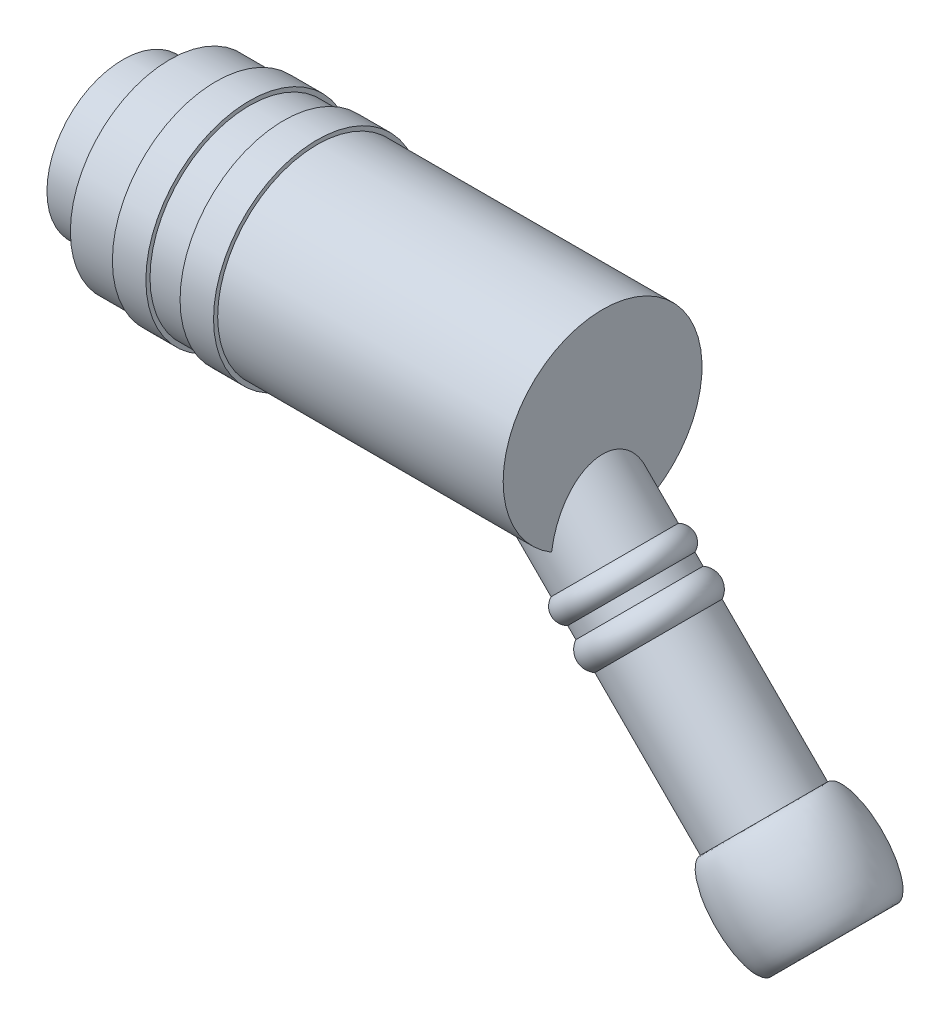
ISO-10303-21;
HEADER;
FILE_DESCRIPTION(('STEP AP214'),'2;1');
FILE_NAME('part.step','',(''),(''),'','','');
FILE_SCHEMA(('AUTOMOTIVE_DESIGN { 1 0 10303 214 1 1 1 1 }'));
ENDSEC;
DATA;
#1=APPLICATION_CONTEXT('core data for automotive mechanical design processes');
#2=APPLICATION_PROTOCOL_DEFINITION('international standard','automotive_design',2000,#1);
#3=PRODUCT_CONTEXT('',#1,'mechanical');
#4=PRODUCT('Part','Part','',(#3));
#5=PRODUCT_RELATED_PRODUCT_CATEGORY('part','',(#4));
#6=PRODUCT_DEFINITION_FORMATION('','',#4);
#7=PRODUCT_DEFINITION_CONTEXT('part definition',#1,'design');
#8=PRODUCT_DEFINITION('design','',#6,#7);
#9=PRODUCT_DEFINITION_SHAPE('','',#8);
#10=(LENGTH_UNIT() NAMED_UNIT(*) SI_UNIT(.MILLI.,.METRE.));
#11=(NAMED_UNIT(*) PLANE_ANGLE_UNIT() SI_UNIT($,.RADIAN.));
#12=(NAMED_UNIT(*) SI_UNIT($,.STERADIAN.) SOLID_ANGLE_UNIT());
#13=UNCERTAINTY_MEASURE_WITH_UNIT(LENGTH_MEASURE(1.E-05),#10,'distance_accuracy_value','');
#14=(GEOMETRIC_REPRESENTATION_CONTEXT(3) GLOBAL_UNCERTAINTY_ASSIGNED_CONTEXT((#13)) GLOBAL_UNIT_ASSIGNED_CONTEXT((#10,
#11,#12)) REPRESENTATION_CONTEXT('',''));
#15=CARTESIAN_POINT('',(0.,0.,0.));
#16=DIRECTION('',(0.,0.,1.));
#17=DIRECTION('',(1.,0.,0.));
#18=AXIS2_PLACEMENT_3D('',#15,#16,#17);
#19=CARTESIAN_POINT('',(0.,0.,0.));
#20=DIRECTION('',(-1.,0.,0.));
#21=DIRECTION('',(0.,0.,1.));
#22=AXIS2_PLACEMENT_3D('',#19,#20,#21);
#23=CYLINDRICAL_SURFACE('',#22,8.5);
#24=CARTESIAN_POINT('',(41.,0.,0.));
#25=DIRECTION('',(-1.,0.,0.));
#26=DIRECTION('',(0.,0.,1.));
#27=AXIS2_PLACEMENT_3D('',#24,#25,#26);
#28=CIRCLE('',#27,8.5);
#29=CARTESIAN_POINT('',(41.,-7.96207763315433,-2.97578893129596));
#30=VERTEX_POINT('',#29);
#31=CARTESIAN_POINT('',(41.,-7.98820135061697,-2.90493359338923));
#32=VERTEX_POINT('',#31);
#33=EDGE_CURVE('E248',#30,#32,#28,.T.);
#34=ORIENTED_EDGE('',*,*,#33,.T.);
#35=CARTESIAN_POINT('',(41.,-7.98820135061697,-2.90493359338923));
#36=CARTESIAN_POINT('',(40.8505286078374,-7.982573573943,-2.92033660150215));
#37=CARTESIAN_POINT('',(40.7003847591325,-7.97879516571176,-2.93065460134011));
#38=CARTESIAN_POINT('',(40.3993096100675,-7.97530166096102,-2.94018818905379));
#39=CARTESIAN_POINT('',(40.2483772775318,-7.97559742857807,-2.93937409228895));
#40=CARTESIAN_POINT('',(39.9454956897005,-7.98067758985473,-2.92554595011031));
#41=CARTESIAN_POINT('',(39.7935525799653,-7.98550946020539,-2.91240286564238));
#42=CARTESIAN_POINT('',(39.4918540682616,-7.99995656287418,-2.87248054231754));
#43=CARTESIAN_POINT('',(39.3420963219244,-8.009566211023,-2.84571722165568));
#44=CARTESIAN_POINT('',(39.0026671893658,-8.03715354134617,-2.76703050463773));
#45=CARTESIAN_POINT('',(38.8142600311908,-8.05676385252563,-2.7100127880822));
#46=CARTESIAN_POINT('',(38.4496669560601,-8.10316358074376,-2.56793619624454));
#47=CARTESIAN_POINT('',(38.2734409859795,-8.12992790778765,-2.48297508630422));
#48=CARTESIAN_POINT('',(38.0221388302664,-8.17379725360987,-2.33275693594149));
#49=CARTESIAN_POINT('',(37.9400793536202,-8.1891472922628,-2.27848135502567));
#50=CARTESIAN_POINT('',(37.7816819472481,-8.2205757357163,-2.16235079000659));
#51=CARTESIAN_POINT('',(37.7053409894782,-8.23665374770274,-2.10049986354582));
#52=CARTESIAN_POINT('',(37.5593123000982,-8.2689888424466,-1.969360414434));
#53=CARTESIAN_POINT('',(37.4896273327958,-8.28524599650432,-1.90006882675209));
#54=CARTESIAN_POINT('',(37.3578971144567,-8.31729351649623,-1.75447378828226));
#55=CARTESIAN_POINT('',(37.2958501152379,-8.33308398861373,-1.67817194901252));
#56=CARTESIAN_POINT('',(37.1888440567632,-8.36126816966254,-1.53099465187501));
#57=CARTESIAN_POINT('',(37.1427157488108,-8.37381804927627,-1.46099644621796));
#58=CARTESIAN_POINT('',(37.057082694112,-8.39768983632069,-1.31686662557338));
#59=CARTESIAN_POINT('',(37.0175768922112,-8.40901193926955,-1.24273567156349));
#60=CARTESIAN_POINT('',(36.9456302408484,-8.43003584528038,-1.091031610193));
#61=CARTESIAN_POINT('',(36.9131794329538,-8.43973992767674,-1.01346354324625));
#62=CARTESIAN_POINT('',(36.8555989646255,-8.45721363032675,-0.855482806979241));
#63=CARTESIAN_POINT('',(36.8304657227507,-8.46498419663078,-0.775071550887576));
#64=CARTESIAN_POINT('',(36.7903517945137,-8.47751076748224,-0.622056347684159));
#65=CARTESIAN_POINT('',(36.7745059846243,-8.48251905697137,-0.549698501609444));
#66=CARTESIAN_POINT('',(36.748749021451,-8.49071101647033,-0.403958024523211));
#67=CARTESIAN_POINT('',(36.7388279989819,-8.49389772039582,-0.330577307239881));
#68=CARTESIAN_POINT('',(36.731903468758,-8.4961175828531,-0.256877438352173));
#69=B_SPLINE_CURVE_WITH_KNOTS('',3,(#35,#36,#37,#38,#39,#40,#41,#42,#43,#44,#45,#46,#47,#48,#49,
#50,#51,#52,#53,#54,#55,#56,#57,#58,#59,#60,#61,#62,#63,#64,#65,#66,#67,#68),.UNSPECIFIED.,.F.,
.F.,(4,2,2,2,2,2,2,2,2,2,2,2,2,2,2,2,4),(0.,0.451121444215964,0.903446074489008,
1.36055833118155,1.81713757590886,2.40846501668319,2.99774520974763,3.29608892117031,
3.5942735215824,3.89258142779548,4.19082092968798,4.4447642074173,4.69866698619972,
4.95220900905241,5.20562673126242,5.42808995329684,5.65018156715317),.UNSPECIFIED.);
#70=CARTESIAN_POINT('',(37.6944185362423,-8.23926926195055,-2.08912470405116));
#71=VERTEX_POINT('',#70);
#72=EDGE_CURVE('E23',#32,#71,#69,.T.);
#73=ORIENTED_EDGE('',*,*,#72,.T.);
#74=CARTESIAN_POINT('',(36.7573593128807,-8.5,0.));
#75=CARTESIAN_POINT('',(36.7573655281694,-8.49999480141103,-0.152524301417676));
#76=CARTESIAN_POINT('',(36.7697542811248,-8.49584894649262,-0.305279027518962));
#77=CARTESIAN_POINT('',(36.8190540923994,-8.47967835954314,-0.606572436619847));
#78=CARTESIAN_POINT('',(36.8560204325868,-8.46763586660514,-0.75510082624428));
#79=CARTESIAN_POINT('',(36.953418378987,-8.43697642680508,-1.04325489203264));
#80=CARTESIAN_POINT('',(37.0138088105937,-8.41837102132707,-1.18289569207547));
#81=CARTESIAN_POINT('',(37.1562533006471,-8.3765447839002,-1.44974614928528));
#82=CARTESIAN_POINT('',(37.2382958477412,-8.35332640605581,-1.57696236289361));
#83=CARTESIAN_POINT('',(37.4232451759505,-8.30415131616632,-1.81839359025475));
#84=CARTESIAN_POINT('',(37.5265086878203,-8.27815201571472,-1.93232571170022));
#85=CARTESIAN_POINT('',(37.749644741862,-8.22625949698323,-2.14252405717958));
#86=CARTESIAN_POINT('',(37.8695220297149,-8.2003663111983,-2.23878521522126));
#87=CARTESIAN_POINT('',(38.1327570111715,-8.14877411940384,-2.4201490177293));
#88=CARTESIAN_POINT('',(38.2772369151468,-8.12326857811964,-2.50366858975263));
#89=CARTESIAN_POINT('',(38.5771246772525,-8.07681292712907,-2.64971469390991));
#90=CARTESIAN_POINT('',(38.7325397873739,-8.05586587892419,-2.71222713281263));
#91=CARTESIAN_POINT('',(39.0110320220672,-8.02408437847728,-2.80460272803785));
#92=CARTESIAN_POINT('',(39.1326018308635,-8.01203014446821,-2.83871695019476));
#93=CARTESIAN_POINT('',(39.3784905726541,-7.99126777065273,-2.89665189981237));
#94=CARTESIAN_POINT('',(39.5028106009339,-7.9825609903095,-2.92046844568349));
#95=CARTESIAN_POINT('',(39.7532447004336,-7.96850580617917,-2.95860189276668));
#96=CARTESIAN_POINT('',(39.879361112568,-7.96316229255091,-2.97290496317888));
#97=CARTESIAN_POINT('',(40.132389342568,-7.95574038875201,-2.9927079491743));
#98=CARTESIAN_POINT('',(40.2593013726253,-7.95366291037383,-2.99820540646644));
#99=CARTESIAN_POINT('',(40.5604564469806,-7.95239266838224,-3.00157841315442));
#100=CARTESIAN_POINT('',(40.7347501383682,-7.95455993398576,-2.99585937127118));
#101=CARTESIAN_POINT('',(41.0821891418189,-7.96409140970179,-2.97042417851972));
#102=CARTESIAN_POINT('',(41.2553339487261,-7.97145777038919,-2.95070223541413));
#103=CARTESIAN_POINT('',(41.5999770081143,-7.99074535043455,-2.8980644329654));
#104=CARTESIAN_POINT('',(41.7714670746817,-8.00268289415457,-2.86510126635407));
#105=CARTESIAN_POINT('',(42.1111425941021,-8.03040442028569,-2.78645702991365));
#106=CARTESIAN_POINT('',(42.2793287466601,-8.04618757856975,-2.74077868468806));
#107=CARTESIAN_POINT('',(42.6152569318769,-8.08129035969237,-2.63550788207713));
#108=CARTESIAN_POINT('',(42.7828981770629,-8.10068351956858,-2.57561726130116));
#109=CARTESIAN_POINT('',(43.1124160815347,-8.14196549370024,-2.44198705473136));
#110=CARTESIAN_POINT('',(43.2742889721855,-8.16385590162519,-2.36823860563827));
#111=CARTESIAN_POINT('',(43.5891914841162,-8.20908024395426,-2.20636106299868));
#112=CARTESIAN_POINT('',(43.7422713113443,-8.23240398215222,-2.11832756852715));
#113=CARTESIAN_POINT('',(44.037594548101,-8.27951781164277,-1.92598183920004));
#114=CARTESIAN_POINT('',(44.1798564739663,-8.30330701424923,-1.82169839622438));
#115=CARTESIAN_POINT('',(44.4146785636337,-8.3439700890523,-1.62345200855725));
#116=CARTESIAN_POINT('',(44.5106680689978,-8.36106184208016,-1.53362715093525));
#117=CARTESIAN_POINT('',(44.6910922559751,-8.39386722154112,-1.34254254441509));
#118=CARTESIAN_POINT('',(44.7755189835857,-8.40957989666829,-1.24127501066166));
#119=CARTESIAN_POINT('',(44.9293582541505,-8.43866450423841,-1.02514528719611));
#120=CARTESIAN_POINT('',(44.9985570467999,-8.45200266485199,-0.910120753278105));
#121=CARTESIAN_POINT('',(45.0851972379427,-8.46887358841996,-0.729275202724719));
#122=CARTESIAN_POINT('',(45.1112039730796,-8.47397174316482,-0.667660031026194));
#123=CARTESIAN_POINT('',(45.1567429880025,-8.4829352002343,-0.542012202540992));
#124=CARTESIAN_POINT('',(45.1762785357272,-8.4868011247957,-0.477980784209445));
#125=CARTESIAN_POINT('',(45.2148749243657,-8.4944576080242,-0.320510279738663));
#126=CARTESIAN_POINT('',(45.2302394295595,-8.49752454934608,-0.226088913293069));
#127=CARTESIAN_POINT('',(45.2449224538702,-8.50045503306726,-0.0359990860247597));
#128=CARTESIAN_POINT('',(45.2442492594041,-8.50032022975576,0.0596687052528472));
#129=CARTESIAN_POINT('',(45.2269627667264,-8.49687110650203,0.249340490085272));
#130=CARTESIAN_POINT('',(45.2103706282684,-8.49356100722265,0.343346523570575));
#131=CARTESIAN_POINT('',(45.1627495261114,-8.48412110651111,0.527463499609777));
#132=CARTESIAN_POINT('',(45.131708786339,-8.47798900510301,0.617571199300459));
#133=CARTESIAN_POINT('',(45.0434214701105,-8.46070578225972,0.825240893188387));
#134=CARTESIAN_POINT('',(44.9807094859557,-8.44853438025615,0.940380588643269));
#135=CARTESIAN_POINT('',(44.8380351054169,-8.42133057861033,1.15906139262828));
#136=CARTESIAN_POINT('',(44.7580328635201,-8.40629158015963,1.26257485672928));
#137=CARTESIAN_POINT('',(44.6040135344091,-8.37796698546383,1.43726227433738));
#138=CARTESIAN_POINT('',(44.5323658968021,-8.36499264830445,1.51062208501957));
#139=CARTESIAN_POINT('',(44.3829659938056,-8.33846666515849,1.65077744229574));
#140=CARTESIAN_POINT('',(44.3052101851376,-8.3249146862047,1.71756912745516));
#141=CARTESIAN_POINT('',(44.1447654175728,-8.29757795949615,1.8451178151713));
#142=CARTESIAN_POINT('',(44.0620688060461,-8.28379287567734,1.90586504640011));
#143=CARTESIAN_POINT('',(43.8927596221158,-8.25629351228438,2.02167136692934));
#144=CARTESIAN_POINT('',(43.8061457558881,-8.24257925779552,2.07672855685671));
#145=CARTESIAN_POINT('',(43.5746690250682,-8.20700286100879,2.21423972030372));
#146=CARTESIAN_POINT('',(43.427178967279,-8.1853955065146,2.29235563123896));
#147=CARTESIAN_POINT('',(43.1258715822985,-8.14384500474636,2.43584744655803));
#148=CARTESIAN_POINT('',(42.9720504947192,-8.12390286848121,2.50121564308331));
#149=CARTESIAN_POINT('',(42.6592742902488,-8.0863673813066,2.62002819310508));
#150=CARTESIAN_POINT('',(42.5003101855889,-8.06877845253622,2.6734502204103));
#151=CARTESIAN_POINT('',(42.1786434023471,-8.03665601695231,2.76851454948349));
#152=CARTESIAN_POINT('',(42.015941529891,-8.02212185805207,2.81015936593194));
#153=CARTESIAN_POINT('',(41.6814535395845,-7.99625949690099,2.88294707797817));
#154=CARTESIAN_POINT('',(41.5095565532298,-7.98507330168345,2.91363332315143));
#155=CARTESIAN_POINT('',(41.1636120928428,-7.96737001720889,2.96170089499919));
#156=CARTESIAN_POINT('',(40.9895640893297,-7.96085410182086,2.97907887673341));
#157=CARTESIAN_POINT('',(40.6409531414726,-7.95318591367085,2.99949372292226));
#158=CARTESIAN_POINT('',(40.4663929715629,-7.95201878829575,3.00257030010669));
#159=CARTESIAN_POINT('',(40.1178464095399,-7.95559846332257,2.99307089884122));
#160=CARTESIAN_POINT('',(39.9438597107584,-7.96034129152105,2.98050543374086));
#161=CARTESIAN_POINT('',(39.5560940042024,-7.97809282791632,2.93273246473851));
#162=CARTESIAN_POINT('',(39.3429336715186,-7.99283200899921,2.8927595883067));
#163=CARTESIAN_POINT('',(38.9258049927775,-8.03209503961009,2.78189572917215));
#164=CARTESIAN_POINT('',(38.7218236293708,-8.05660451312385,2.71105015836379));
#165=CARTESIAN_POINT('',(38.3628817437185,-8.10897978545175,2.54957282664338));
#166=CARTESIAN_POINT('',(38.2054156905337,-8.13560631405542,2.46420317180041));
#167=CARTESIAN_POINT('',(37.9819030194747,-8.1780737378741,2.31768700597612));
#168=CARTESIAN_POINT('',(37.9094874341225,-8.19265699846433,2.26574747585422));
#169=CARTESIAN_POINT('',(37.7695652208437,-8.22228103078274,2.1557691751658));
#170=CARTESIAN_POINT('',(37.7020564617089,-8.23732159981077,2.09773307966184));
#171=CARTESIAN_POINT('',(37.5721845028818,-8.26753477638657,1.97531444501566));
#172=CARTESIAN_POINT('',(37.5098596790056,-8.28270758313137,1.91089119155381));
#173=CARTESIAN_POINT('',(37.3915711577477,-8.31259091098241,1.7763934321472));
#174=CARTESIAN_POINT('',(37.3356044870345,-8.32730164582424,1.70632159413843));
#175=CARTESIAN_POINT('',(37.2305833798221,-8.35577525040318,1.5609318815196));
#176=CARTESIAN_POINT('',(37.1815326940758,-8.36953760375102,1.48561119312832));
#177=CARTESIAN_POINT('',(37.090916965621,-8.39561334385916,1.33036354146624));
#178=CARTESIAN_POINT('',(37.0493507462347,-8.40792695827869,1.25043730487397));
#179=CARTESIAN_POINT('',(36.9784559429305,-8.42935013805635,1.09608976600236));
#180=CARTESIAN_POINT('',(36.9482704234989,-8.4386652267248,1.02208917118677));
#181=CARTESIAN_POINT('',(36.8943459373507,-8.45553500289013,0.871584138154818));
#182=CARTESIAN_POINT('',(36.8706063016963,-8.46308987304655,0.795079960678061));
#183=CARTESIAN_POINT('',(36.8298052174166,-8.47620065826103,0.640342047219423));
#184=CARTESIAN_POINT('',(36.8127280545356,-8.48176127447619,0.562112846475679));
#185=CARTESIAN_POINT('',(36.7853069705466,-8.49074168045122,0.404398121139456));
#186=CARTESIAN_POINT('',(36.7749591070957,-8.49416272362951,0.324913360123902));
#187=CARTESIAN_POINT('',(36.764461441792,-8.49764046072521,0.204376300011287));
#188=CARTESIAN_POINT('',(36.7617991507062,-8.49852428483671,0.163552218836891));
#189=CARTESIAN_POINT('',(36.7582472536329,-8.49970475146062,0.0818242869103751));
#190=CARTESIAN_POINT('',(36.7573576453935,-8.50000139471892,0.0409204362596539));
#191=CARTESIAN_POINT('',(36.7573593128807,-8.5,0.));
#192=B_SPLINE_CURVE_WITH_KNOTS('',3,(#74,#75,#76,#77,#78,#79,#80,#81,#82,#83,#84,#85,#86,#87,
#88,#89,#90,#91,#92,#93,#94,#95,#96,#97,#98,#99,#100,#101,#102,#103,#104,#105,#106,#107,#108,
#109,#110,#111,#112,#113,#114,#115,#116,#117,#118,#119,#120,#121,#122,#123,#124,#125,#126,#127,
#128,#129,#130,#131,#132,#133,#134,#135,#136,#137,#138,#139,#140,#141,#142,#143,#144,#145,#146,
#147,#148,#149,#150,#151,#152,#153,#154,#155,#156,#157,#158,#159,#160,#161,#162,#163,#164,#165,
#166,#167,#168,#169,#170,#171,#172,#173,#174,#175,#176,#177,#178,#179,#180,#181,#182,#183,#184,
#185,#186,#187,#188,#189,#190,#191),.UNSPECIFIED.,.T.,.F.,(4,2,2,2,2,2,2,2,2,2,2,2,2,2,2,2,2,2,
2,2,2,2,2,2,2,2,2,2,2,2,2,2,2,2,2,2,2,2,2,2,2,2,2,2,2,2,2,2,2,2,2,2,2,2,2,2,2,2,4),(0.,
0.457420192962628,0.915872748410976,1.37352306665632,1.83093056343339,2.29676987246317,
2.76274252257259,3.26728388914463,3.77216306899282,4.1521886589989,4.53236842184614,
4.91309969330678,5.29393723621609,5.81639696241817,6.33907292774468,6.86363312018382,
7.38808099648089,7.924693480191,8.46165035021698,8.99515170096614,9.52771831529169,
9.92461989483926,10.3217931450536,10.7242287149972,10.9251322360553,11.1259341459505,
11.4116759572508,11.6972701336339,11.9824852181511,12.2679331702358,12.6607523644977,
13.0544866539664,13.3641503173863,13.6739949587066,13.9843326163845,14.2947735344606,
14.7988973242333,15.3033249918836,15.8086876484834,16.3139423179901,16.8383020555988,
17.3627935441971,17.8858277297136,18.4085105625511,19.0583740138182,19.7072847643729,
20.2480964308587,20.5187134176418,20.7892121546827,21.0615620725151,21.3337840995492,
21.606153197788,21.8784794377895,22.1195569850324,22.3606095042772,22.6010899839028,
22.8414294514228,22.9641499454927,23.0868702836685),.UNSPECIFIED.);
#193=EDGE_CURVE('E115',#71,#30,#192,.T.);
#194=ORIENTED_EDGE('',*,*,#193,.T.);
#195=EDGE_LOOP('',(#34,#73,#194));
#196=FACE_BOUND('',#195,.T.);
#197=ADVANCED_FACE('F15',(#196),#23,.T.);
#198=CARTESIAN_POINT('',(38.6015932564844,0.,0.));
#199=DIRECTION('',(1.,0.,0.));
#200=DIRECTION('',(0.,0.,-1.));
#201=AXIS2_PLACEMENT_3D('',#198,#199,#200);
#202=PLANE('',#201);
#203=CARTESIAN_POINT('',(38.6015932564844,0.,0.));
#204=DIRECTION('',(-1.,0.,0.));
#205=DIRECTION('',(0.,0.,1.));
#206=AXIS2_PLACEMENT_3D('',#203,#204,#205);
#207=CIRCLE('',#206,4.5);
#208=CARTESIAN_POINT('',(38.6015932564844,-3.74517679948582,-2.49472458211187));
#209=VERTEX_POINT('',#208);
#210=CARTESIAN_POINT('',(38.6015932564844,-3.81375135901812,-2.38857710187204));
#211=VERTEX_POINT('',#210);
#212=EDGE_CURVE('E274',#209,#211,#207,.T.);
#213=ORIENTED_EDGE('',*,*,#212,.T.);
#214=CARTESIAN_POINT('',(38.6015932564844,-6.22726694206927,0.));
#215=DIRECTION('',(1.,0.,0.));
#216=DIRECTION('',(0.,-1.,0.));
#217=AXIS2_PLACEMENT_3D('',#214,#215,#216);
#218=ELLIPSE('',#217,4.14381934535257,2.93842911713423);
#219=CARTESIAN_POINT('',(38.6015932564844,-3.81375135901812,2.38857710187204));
#220=VERTEX_POINT('',#219);
#221=EDGE_CURVE('E29',#211,#220,#218,.T.);
#222=ORIENTED_EDGE('',*,*,#221,.T.);
#223=CARTESIAN_POINT('',(38.6015932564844,-3.74517679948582,2.49472458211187));
#224=VERTEX_POINT('',#223);
#225=EDGE_CURVE('E275',#220,#224,#207,.T.);
#226=ORIENTED_EDGE('',*,*,#225,.T.);
#227=CARTESIAN_POINT('',(38.6015932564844,-6.10159325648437,0.));
#228=DIRECTION('',(1.,0.,0.));
#229=DIRECTION('',(0.,1.,0.));
#230=AXIS2_PLACEMENT_3D('',#227,#228,#229);
#231=ELLIPSE('',#230,4.24264068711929,3.);
#232=EDGE_CURVE('E199',#224,#209,#231,.F.);
#233=ORIENTED_EDGE('',*,*,#232,.T.);
#234=EDGE_LOOP('',(#213,#222,#226,#233));
#235=FACE_BOUND('',#234,.T.);
#236=ADVANCED_FACE('F239',(#235),#202,.F.);
#237=DIRECTION('',(0.,0.,1.));
#238=VECTOR('',#237,1.);
#239=CARTESIAN_POINT('',(38.6015932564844,-1.40286832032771,0.));
#240=LINE('',#239,#238);
#241=CARTESIAN_POINT('',(38.6015932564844,-1.40286832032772,-2.95321207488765));
#242=VERTEX_POINT('',#241);
#243=CARTESIAN_POINT('',(38.6015932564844,-1.40286832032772,2.95321207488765));
#244=VERTEX_POINT('',#243);
#245=EDGE_CURVE('E259',#242,#244,#240,.T.);
#246=ORIENTED_EDGE('',*,*,#245,.T.);
#247=CARTESIAN_POINT('',(38.6015932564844,-6.10159325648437,0.));
#248=DIRECTION('',(1.,0.,0.));
#249=DIRECTION('',(0.,1.,0.));
#250=AXIS2_PLACEMENT_3D('',#247,#248,#249);
#251=ELLIPSE('',#250,6.2865681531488,4.4452749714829);
#252=CARTESIAN_POINT('',(38.6015932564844,-2.583908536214,3.68421181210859));
#253=VERTEX_POINT('',#252);
#254=EDGE_CURVE('E192',#244,#253,#251,.T.);
#255=ORIENTED_EDGE('',*,*,#254,.T.);
#256=CARTESIAN_POINT('',(38.6015932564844,-2.583908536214,-3.68421181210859));
#257=VERTEX_POINT('',#256);
#258=EDGE_CURVE('E280',#253,#257,#207,.T.);
#259=ORIENTED_EDGE('',*,*,#258,.T.);
#260=EDGE_CURVE('E582',#257,#242,#251,.T.);
#261=ORIENTED_EDGE('',*,*,#260,.T.);
#262=EDGE_LOOP('',(#246,#255,#259,#261));
#263=FACE_BOUND('',#262,.T.);
#264=ADVANCED_FACE('F17',(#263),#202,.F.);
#265=CARTESIAN_POINT('',(0.,0.,0.));
#266=DIRECTION('',(-1.,0.,0.));
#267=DIRECTION('',(0.,0.,1.));
#268=AXIS2_PLACEMENT_3D('',#265,#266,#267);
#269=CYLINDRICAL_SURFACE('',#268,4.5);
#270=ORIENTED_EDGE('',*,*,#225,.F.);
#271=CARTESIAN_POINT('',(38.6015932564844,-3.81375135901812,2.38857710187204));
#272=CARTESIAN_POINT('',(38.4988231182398,-3.78908988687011,2.427943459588));
#273=CARTESIAN_POINT('',(38.3951321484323,-3.7649140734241,2.46519820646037));
#274=CARTESIAN_POINT('',(38.1860656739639,-3.71786035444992,2.53561041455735));
#275=CARTESIAN_POINT('',(38.0806900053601,-3.69498257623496,2.56876747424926));
#276=CARTESIAN_POINT('',(37.867731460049,-3.65071095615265,2.63130815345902));
#277=CARTESIAN_POINT('',(37.7601386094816,-3.62932789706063,2.66066544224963));
#278=CARTESIAN_POINT('',(37.5435527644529,-3.58859847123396,2.71534971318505));
#279=CARTESIAN_POINT('',(37.4345598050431,-3.56925205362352,2.74067679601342));
#280=CARTESIAN_POINT('',(37.2120157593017,-3.53249657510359,2.78790052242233));
#281=CARTESIAN_POINT('',(37.098425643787,-3.51516244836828,2.80967241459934));
#282=CARTESIAN_POINT('',(36.870021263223,-3.48368812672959,2.84860388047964));
#283=CARTESIAN_POINT('',(36.7552071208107,-3.46954761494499,2.86576391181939));
#284=CARTESIAN_POINT('',(36.5248230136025,-3.44515656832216,2.89504037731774));
#285=CARTESIAN_POINT('',(36.4092558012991,-3.43489598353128,2.90716984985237));
#286=CARTESIAN_POINT('',(36.1773801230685,-3.41898785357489,2.92586335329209));
#287=CARTESIAN_POINT('',(36.0610720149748,-3.4133382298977,2.93242989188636));
#288=CARTESIAN_POINT('',(35.857761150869,-3.40825695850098,2.93833172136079));
#289=CARTESIAN_POINT('',(35.7708302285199,-3.4076091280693,2.93908162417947));
#290=CARTESIAN_POINT('',(35.5970516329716,-3.40973938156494,2.93661061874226));
#291=CARTESIAN_POINT('',(35.5102039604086,-3.41251749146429,2.93338968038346));
#292=CARTESIAN_POINT('',(35.3373870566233,-3.42184686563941,2.92250169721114));
#293=CARTESIAN_POINT('',(35.2514156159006,-3.42838037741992,2.91485556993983));
#294=CARTESIAN_POINT('',(35.0804531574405,-3.44551659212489,2.89457989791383));
#295=CARTESIAN_POINT('',(34.9954621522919,-3.45611934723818,2.88195028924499));
#296=CARTESIAN_POINT('',(34.8258269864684,-3.48178399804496,2.85089344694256));
#297=CARTESIAN_POINT('',(34.7412082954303,-3.49691201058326,2.83237997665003));
#298=CARTESIAN_POINT('',(34.5745059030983,-3.53156431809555,2.7890540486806));
#299=CARTESIAN_POINT('',(34.4924220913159,-3.55108842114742,2.76424186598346));
#300=CARTESIAN_POINT('',(34.3317654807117,-3.59424572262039,2.70788751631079));
#301=CARTESIAN_POINT('',(34.2531904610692,-3.617876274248,2.67634968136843));
#302=CARTESIAN_POINT('',(34.1004230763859,-3.66867457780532,2.60628003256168));
#303=CARTESIAN_POINT('',(34.0262301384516,-3.69584186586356,2.56774913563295));
#304=CARTESIAN_POINT('',(33.8917834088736,-3.74936852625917,2.48881902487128));
#305=CARTESIAN_POINT('',(33.8309339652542,-3.7754212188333,2.4492229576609));
#306=CARTESIAN_POINT('',(33.7136245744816,-3.82889713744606,2.36475069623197));
#307=CARTESIAN_POINT('',(33.6571662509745,-3.8563208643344,2.31987256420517));
#308=CARTESIAN_POINT('',(33.548943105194,-3.91178027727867,2.22508119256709));
#309=CARTESIAN_POINT('',(33.4971795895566,-3.93981613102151,2.17516655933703));
#310=CARTESIAN_POINT('',(33.3985223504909,-3.99574050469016,2.07064795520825));
#311=CARTESIAN_POINT('',(33.3516305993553,-4.02362896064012,2.016042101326));
#312=CARTESIAN_POINT('',(33.2231795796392,-4.10301790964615,1.85186485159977));
#313=CARTESIAN_POINT('',(33.1479702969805,-4.15341006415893,1.73668033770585));
#314=CARTESIAN_POINT('',(33.0152789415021,-4.24677896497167,1.49392707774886));
#315=CARTESIAN_POINT('',(32.9577955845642,-4.28975624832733,1.36635922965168));
#316=CARTESIAN_POINT('',(32.8562273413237,-4.36813621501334,1.09148720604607));
#317=CARTESIAN_POINT('',(32.8135404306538,-4.40268458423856,0.943419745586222));
#318=CARTESIAN_POINT('',(32.7477360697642,-4.45686808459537,0.640349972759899));
#319=CARTESIAN_POINT('',(32.7246244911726,-4.47649874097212,0.485345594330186));
#320=CARTESIAN_POINT('',(32.6971713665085,-4.49987912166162,0.166328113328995));
#321=CARTESIAN_POINT('',(32.6936031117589,-4.50297446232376,0.00220036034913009));
#322=CARTESIAN_POINT('',(32.7072959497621,-4.4912478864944,-0.324635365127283));
#323=CARTESIAN_POINT('',(32.7245588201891,-4.47642444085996,-0.487343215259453));
#324=CARTESIAN_POINT('',(32.7662806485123,-4.44160507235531,-0.727174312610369));
#325=CARTESIAN_POINT('',(32.7829129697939,-4.42783003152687,-0.806686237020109));
#326=CARTESIAN_POINT('',(32.8215548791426,-4.39634864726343,-0.963587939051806));
#327=CARTESIAN_POINT('',(32.8435624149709,-4.37864380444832,-1.04097851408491));
#328=CARTESIAN_POINT('',(32.8930348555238,-4.3396604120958,-1.19311450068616));
#329=CARTESIAN_POINT('',(32.9205027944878,-4.31837987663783,-1.26785841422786));
#330=CARTESIAN_POINT('',(32.9809521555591,-4.27273538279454,-1.41406973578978));
#331=CARTESIAN_POINT('',(33.0139312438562,-4.24837273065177,-1.48553851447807));
#332=CARTESIAN_POINT('',(33.0850742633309,-4.19742579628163,-1.62388071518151));
#333=CARTESIAN_POINT('',(33.1231746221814,-4.17087009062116,-1.69079732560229));
#334=CARTESIAN_POINT('',(33.2048753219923,-4.11597082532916,-1.82036596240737));
#335=CARTESIAN_POINT('',(33.2484732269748,-4.0876280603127,-1.88301985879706));
#336=CARTESIAN_POINT('',(33.3411652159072,-4.02991190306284,-2.00356539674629));
#337=CARTESIAN_POINT('',(33.3902568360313,-4.00053897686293,-2.06145915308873));
#338=CARTESIAN_POINT('',(33.4938727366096,-3.94158954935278,-2.17204937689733));
#339=CARTESIAN_POINT('',(33.5483965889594,-3.91201306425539,-2.22474625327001));
#340=CARTESIAN_POINT('',(33.6592643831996,-3.85529211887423,-2.32156893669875));
#341=CARTESIAN_POINT('',(33.7153052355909,-3.8281078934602,-2.36601864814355));
#342=CARTESIAN_POINT('',(33.8317470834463,-3.77507415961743,-2.44974948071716));
#343=CARTESIAN_POINT('',(33.8921494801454,-3.7492250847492,-2.48902892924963));
#344=CARTESIAN_POINT('',(34.0168299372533,-3.69958203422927,-2.56223551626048));
#345=CARTESIAN_POINT('',(34.0811043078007,-3.67578615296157,-2.59616764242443));
#346=CARTESIAN_POINT('',(34.2130583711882,-3.63078481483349,-2.65873679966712));
#347=CARTESIAN_POINT('',(34.2807393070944,-3.60958031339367,-2.68737187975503));
#348=CARTESIAN_POINT('',(34.4800865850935,-3.5527956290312,-2.76251393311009));
#349=CARTESIAN_POINT('',(34.615407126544,-3.52108570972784,-2.80243129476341));
#350=CARTESIAN_POINT('',(34.8918980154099,-3.46969587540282,-2.86581118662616));
#351=CARTESIAN_POINT('',(35.0330705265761,-3.45002045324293,-2.88926757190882));
#352=CARTESIAN_POINT('',(35.2932700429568,-3.42440403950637,-2.91954597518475));
#353=CARTESIAN_POINT('',(35.4118919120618,-3.41667297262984,-2.92854726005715));
#354=CARTESIAN_POINT('',(35.6497583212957,-3.4080562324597,-2.93857053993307));
#355=CARTESIAN_POINT('',(35.7690032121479,-3.40717495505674,-2.93958741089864));
#356=CARTESIAN_POINT('',(36.0079741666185,-3.41130271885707,-2.93479444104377));
#357=CARTESIAN_POINT('',(36.127698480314,-3.41634918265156,-2.92894122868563));
#358=CARTESIAN_POINT('',(36.3664006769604,-3.43143510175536,-2.91125143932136));
#359=CARTESIAN_POINT('',(36.4853782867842,-3.44147628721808,-2.89941278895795));
#360=CARTESIAN_POINT('',(36.7782227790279,-3.471415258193,-2.86357368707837));
#361=CARTESIAN_POINT('',(36.9514635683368,-3.49372852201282,-2.83646985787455));
#362=CARTESIAN_POINT('',(37.2950711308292,-3.54507626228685,-2.77202612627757));
#363=CARTESIAN_POINT('',(37.4654360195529,-3.57411497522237,-2.73467976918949));
#364=CARTESIAN_POINT('',(37.7990422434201,-3.63646234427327,-2.65118839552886));
#365=CARTESIAN_POINT('',(37.9623577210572,-3.66966143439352,-2.60525798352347));
#366=CARTESIAN_POINT('',(38.2044144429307,-3.72200892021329,-2.52934611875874));
#367=CARTESIAN_POINT('',(38.2845592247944,-3.73986958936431,-2.5028936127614));
#368=CARTESIAN_POINT('',(38.4438465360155,-3.77630772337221,-2.44756885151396));
#369=CARTESIAN_POINT('',(38.5229890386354,-3.79488520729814,-2.41869653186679));
#370=CARTESIAN_POINT('',(38.6015932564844,-3.81375135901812,-2.38857710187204));
#371=B_SPLINE_CURVE_WITH_KNOTS('',3,(#271,#272,#273,#274,#275,#276,#277,#278,#279,#280,#281,
#282,#283,#284,#285,#286,#287,#288,#289,#290,#291,#292,#293,#294,#295,#296,#297,#298,#299,#300,
#301,#302,#303,#304,#305,#306,#307,#308,#309,#310,#311,#312,#313,#314,#315,#316,#317,#318,#319,
#320,#321,#322,#323,#324,#325,#326,#327,#328,#329,#330,#331,#332,#333,#334,#335,#336,#337,#338,
#339,#340,#341,#342,#343,#344,#345,#346,#347,#348,#349,#350,#351,#352,#353,#354,#355,#356,#357,
#358,#359,#360,#361,#362,#363,#364,#365,#366,#367,#368,#369,#370),.UNSPECIFIED.,.F.,.F.,(4,2,2,
2,2,2,2,2,2,2,2,2,2,2,2,2,2,2,2,2,2,2,2,2,2,2,2,2,2,2,2,2,2,2,2,2,2,2,2,2,2,2,2,2,2,2,2,2,2,4),
(0.,0.338312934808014,0.676658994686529,1.01723666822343,1.35780583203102,1.7085262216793,
2.05921179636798,2.40898268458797,2.75859581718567,3.01927054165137,3.27994724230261,
3.53940169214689,3.7988594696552,4.06231042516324,4.3257498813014,4.58902016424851,
4.85225595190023,5.08333686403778,5.31450281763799,5.54573291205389,5.77705625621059,
6.21454675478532,6.65200555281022,7.12364804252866,7.59543195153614,8.08575544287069,
8.57612078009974,8.82305458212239,9.06989425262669,9.31687147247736,9.56374436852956,
9.8077954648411,10.0517387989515,10.295573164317,10.5393883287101,10.7686447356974,
10.9979751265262,11.2270903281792,11.4562897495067,11.8881805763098,12.3202325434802,
12.6773593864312,13.03471539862,13.3943396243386,13.7540885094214,14.2838111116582,
14.8138683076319,15.3321142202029,15.5908776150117,15.8496478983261),.UNSPECIFIED.);
#372=EDGE_CURVE('E117',#220,#211,#371,.T.);
#373=ORIENTED_EDGE('',*,*,#372,.T.);
#374=ORIENTED_EDGE('',*,*,#212,.F.);
#375=CARTESIAN_POINT('',(36.6119912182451,-3.39247035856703,2.95654272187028));
#376=CARTESIAN_POINT('',(36.7169485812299,-3.40254642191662,2.94497596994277));
#377=CARTESIAN_POINT('',(36.8214916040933,-3.41431653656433,2.93135675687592));
#378=CARTESIAN_POINT('',(37.0296017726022,-3.44075791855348,2.90027716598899));
#379=CARTESIAN_POINT('',(37.1331692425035,-3.45542818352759,2.88281811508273));
#380=CARTESIAN_POINT('',(37.3392750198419,-3.48719382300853,2.84431028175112));
#381=CARTESIAN_POINT('',(37.4418131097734,-3.50428969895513,2.82326075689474));
#382=CARTESIAN_POINT('',(37.6457596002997,-3.54051180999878,2.77770092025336));
#383=CARTESIAN_POINT('',(37.747167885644,-3.55963825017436,2.75319025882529));
#384=CARTESIAN_POINT('',(38.050704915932,-3.61975755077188,2.6742764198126));
#385=CARTESIAN_POINT('',(38.2510082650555,-3.66330746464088,2.61470519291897));
#386=CARTESIAN_POINT('',(38.6457725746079,-3.75484862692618,2.48146593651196));
#387=CARTESIAN_POINT('',(38.8402355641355,-3.80283830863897,2.40780286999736));
#388=CARTESIAN_POINT('',(39.129158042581,-3.8773861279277,2.28435182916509));
#389=CARTESIAN_POINT('',(39.2263355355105,-3.90303853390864,2.24033390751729));
#390=CARTESIAN_POINT('',(39.4184047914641,-3.95472976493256,2.14777244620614));
#391=CARTESIAN_POINT('',(39.5132967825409,-3.98076855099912,2.09922936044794));
#392=CARTESIAN_POINT('',(39.700345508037,-4.03294289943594,1.99716280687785));
#393=CARTESIAN_POINT('',(39.7925025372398,-4.05907845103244,1.94363987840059));
#394=CARTESIAN_POINT('',(39.9733936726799,-4.1110969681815,1.83104337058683));
#395=CARTESIAN_POINT('',(40.0621283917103,-4.13697997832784,1.77197079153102));
#396=CARTESIAN_POINT('',(40.2810277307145,-4.20159151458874,1.61469843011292));
#397=CARTESIAN_POINT('',(40.4084071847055,-4.23990822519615,1.51227346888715));
#398=CARTESIAN_POINT('',(40.5877227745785,-4.29458129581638,1.34534740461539));
#399=CARTESIAN_POINT('',(40.6454913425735,-4.31232468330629,1.28754566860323));
#400=CARTESIAN_POINT('',(40.7560617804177,-4.3464871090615,1.1670374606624));
#401=CARTESIAN_POINT('',(40.808867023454,-4.36290704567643,1.10433437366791));
#402=CARTESIAN_POINT('',(40.9163004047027,-4.39647835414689,0.96285929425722));
#403=CARTESIAN_POINT('',(40.9698040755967,-4.4133070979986,0.883139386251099));
#404=CARTESIAN_POINT('',(41.0651469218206,-4.44342224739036,0.716343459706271));
#405=CARTESIAN_POINT('',(41.1070008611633,-4.45671313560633,0.629276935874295));
#406=CARTESIAN_POINT('',(41.1700130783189,-4.47677491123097,0.46296905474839));
#407=CARTESIAN_POINT('',(41.1933981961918,-4.48424471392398,0.38466951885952));
#408=CARTESIAN_POINT('',(41.2272789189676,-4.49507783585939,0.225057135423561));
#409=CARTESIAN_POINT('',(41.2377875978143,-4.49844532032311,0.14374743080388));
#410=CARTESIAN_POINT('',(41.2448293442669,-4.50070109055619,-0.0197962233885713));
#411=CARTESIAN_POINT('',(41.2413212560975,-4.49957618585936,-0.102032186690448));
#412=CARTESIAN_POINT('',(41.2206342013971,-4.49295336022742,-0.264590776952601));
#413=CARTESIAN_POINT('',(41.203444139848,-4.48745189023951,-0.34491179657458));
#414=CARTESIAN_POINT('',(41.1521776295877,-4.47108999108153,-0.518108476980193));
#415=CARTESIAN_POINT('',(41.1153053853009,-4.45934435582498,-0.610061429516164));
#416=CARTESIAN_POINT('',(41.0279086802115,-4.43164171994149,-0.786493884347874));
#417=CARTESIAN_POINT('',(40.9773595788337,-4.41567711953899,-0.870959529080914));
#418=CARTESIAN_POINT('',(40.8338992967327,-4.37065325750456,-1.07910062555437));
#419=CARTESIAN_POINT('',(40.7334424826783,-4.33937613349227,-1.19703268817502));
#420=CARTESIAN_POINT('',(40.5169594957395,-4.27286713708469,-1.41625375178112));
#421=CARTESIAN_POINT('',(40.4008877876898,-4.23762374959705,-1.51749207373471));
#422=CARTESIAN_POINT('',(40.1624301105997,-4.1664053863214,-1.70311449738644));
#423=CARTESIAN_POINT('',(40.0403548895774,-4.13048770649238,-1.7879264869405));
#424=CARTESIAN_POINT('',(39.7894172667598,-4.05808682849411,-1.94667484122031));
#425=CARTESIAN_POINT('',(39.6605487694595,-4.02160314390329,-2.020601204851));
#426=CARTESIAN_POINT('',(39.3974011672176,-3.94888110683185,-2.15927688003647));
#427=CARTESIAN_POINT('',(39.2631065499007,-3.91264386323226,-2.22399707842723));
#428=CARTESIAN_POINT('',(38.9905716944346,-3.84129493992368,-2.34507646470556));
#429=CARTESIAN_POINT('',(38.8523322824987,-3.80618302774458,-2.40143738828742));
#430=CARTESIAN_POINT('',(38.544130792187,-3.73084888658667,-2.51723240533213));
#431=CARTESIAN_POINT('',(38.3734293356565,-3.69103754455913,-2.57496484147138));
#432=CARTESIAN_POINT('',(38.0279978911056,-3.61542355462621,-2.68009236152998));
#433=CARTESIAN_POINT('',(37.8532680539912,-3.57962075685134,-2.72748783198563));
#434=CARTESIAN_POINT('',(37.5896528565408,-3.5303622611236,-2.79056267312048));
#435=CARTESIAN_POINT('',(37.5020851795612,-3.51476846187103,-2.81015225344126));
#436=CARTESIAN_POINT('',(37.3261421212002,-3.48519795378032,-2.84674355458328));
#437=CARTESIAN_POINT('',(37.2377668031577,-3.47122111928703,-2.86374547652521));
#438=CARTESIAN_POINT('',(37.0602273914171,-3.44514227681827,-2.89506667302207));
#439=CARTESIAN_POINT('',(36.9710630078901,-3.43304099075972,-2.90938491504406));
#440=CARTESIAN_POINT('',(36.7920306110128,-3.41103103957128,-2.93515767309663));
#441=CARTESIAN_POINT('',(36.7021624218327,-3.40112294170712,-2.94661144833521));
#442=CARTESIAN_POINT('',(36.6119912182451,-3.39247035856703,-2.95654272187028));
#443=B_SPLINE_CURVE_WITH_KNOTS('',3,(#375,#376,#377,#378,#379,#380,#381,#382,#383,#384,#385,
#386,#387,#388,#389,#390,#391,#392,#393,#394,#395,#396,#397,#398,#399,#400,#401,#402,#403,#404,
#405,#406,#407,#408,#409,#410,#411,#412,#413,#414,#415,#416,#417,#418,#419,#420,#421,#422,#423,
#424,#425,#426,#427,#428,#429,#430,#431,#432,#433,#434,#435,#436,#437,#438,#439,#440,#441,#442),
.UNSPECIFIED.,.F.,.F.,(4,2,2,2,2,2,2,2,2,2,2,2,2,2,2,2,2,2,2,2,2,2,2,2,2,2,2,2,2,2,2,2,2,4),(0.,
0.318146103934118,0.636182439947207,0.954284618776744,1.27241895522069,1.9121939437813,
2.55174402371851,2.88081575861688,3.20985452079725,3.53885768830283,3.86780166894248,
4.36993810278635,4.62057829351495,4.87104689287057,5.16264357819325,5.45386901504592,
5.69901184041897,5.94390555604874,6.18951885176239,6.43533152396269,6.73296185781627,
7.03113202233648,7.50259963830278,7.97547319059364,8.43356679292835,8.89207867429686,
9.35200974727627,9.81184518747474,10.3650952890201,10.9183246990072,11.1915114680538,
11.4646769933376,11.737947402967,12.0112884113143),.UNSPECIFIED.);
#444=CARTESIAN_POINT('',(36.6119912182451,-3.39247035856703,-2.95654272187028));
#445=VERTEX_POINT('',#444);
#446=EDGE_CURVE('E191',#209,#445,#443,.T.);
#447=ORIENTED_EDGE('',*,*,#446,.T.);
#448=CARTESIAN_POINT('',(40.0044615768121,0.,0.));
#449=DIRECTION('',(-0.707106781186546,0.707106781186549,0.));
#450=DIRECTION('',(-0.707106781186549,-0.707106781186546,0.));
#451=AXIS2_PLACEMENT_3D('',#448,#449,#450);
#452=ELLIPSE('',#451,6.36396103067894,4.5);
#453=CARTESIAN_POINT('',(37.7601275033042,-2.24433407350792,-3.900380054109));
#454=VERTEX_POINT('',#453);
#455=EDGE_CURVE('E628',#445,#454,#452,.F.);
#456=ORIENTED_EDGE('',*,*,#455,.T.);
#457=CARTESIAN_POINT('',(30.7134318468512,-4.5,0.));
#458=CARTESIAN_POINT('',(30.7134319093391,-4.49999984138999,-0.118622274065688));
#459=CARTESIAN_POINT('',(30.7154580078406,-4.49530511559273,-0.237247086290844));
#460=CARTESIAN_POINT('',(30.7235450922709,-4.47657352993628,-0.473663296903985));
#461=CARTESIAN_POINT('',(30.7296076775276,-4.462532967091,-0.591454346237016));
#462=CARTESIAN_POINT('',(30.7457120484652,-4.42526072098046,-0.825275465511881));
#463=CARTESIAN_POINT('',(30.7557531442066,-4.40203063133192,-0.941305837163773));
#464=CARTESIAN_POINT('',(30.779728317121,-4.34661705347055,-1.1708408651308));
#465=CARTESIAN_POINT('',(30.7936639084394,-4.31443008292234,-1.2843445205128));
#466=CARTESIAN_POINT('',(30.8252789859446,-4.24150264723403,-1.50779000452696));
#467=CARTESIAN_POINT('',(30.8429510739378,-4.20077908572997,-1.61773838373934));
#468=CARTESIAN_POINT('',(30.8819082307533,-4.11115985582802,-1.83359049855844));
#469=CARTESIAN_POINT('',(30.9031945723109,-4.06226130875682,-1.93949279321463));
#470=CARTESIAN_POINT('',(30.9722442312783,-3.90397431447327,-2.250065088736));
#471=CARTESIAN_POINT('',(31.0252351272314,-3.78290888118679,-2.44786018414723));
#472=CARTESIAN_POINT('',(31.1149497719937,-3.5794596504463,-2.72975382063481));
#473=CARTESIAN_POINT('',(31.1471348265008,-3.50671101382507,-2.82255000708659));
#474=CARTESIAN_POINT('',(31.2146704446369,-3.35479832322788,-3.00151125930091));
#475=CARTESIAN_POINT('',(31.2500201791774,-3.2756359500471,-3.08767805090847));
#476=CARTESIAN_POINT('',(31.3238040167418,-3.11146165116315,-3.25306199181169));
#477=CARTESIAN_POINT('',(31.3622424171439,-3.02644159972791,-3.33226912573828));
#478=CARTESIAN_POINT('',(31.4420900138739,-2.8513660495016,-3.48325559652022));
#479=CARTESIAN_POINT('',(31.4834990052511,-2.76131089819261,-3.55503544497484));
#480=CARTESIAN_POINT('',(31.5724289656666,-2.57024811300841,-3.69579533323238));
#481=CARTESIAN_POINT('',(31.6201753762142,-2.46891939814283,-3.76419748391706));
#482=CARTESIAN_POINT('',(31.7194223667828,-2.26233204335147,-3.89186284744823));
#483=CARTESIAN_POINT('',(31.7709248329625,-2.15707144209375,-3.95112142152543));
#484=CARTESIAN_POINT('',(31.8783001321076,-1.94423623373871,-4.06007545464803));
#485=CARTESIAN_POINT('',(31.9341627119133,-1.83666746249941,-4.10979245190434));
#486=CARTESIAN_POINT('',(32.0520038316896,-1.62092546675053,-4.19954274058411));
#487=CARTESIAN_POINT('',(32.1139747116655,-1.51275315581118,-4.23958794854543));
#488=CARTESIAN_POINT('',(32.2228454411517,-1.34010867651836,-4.29639192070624));
#489=CARTESIAN_POINT('',(32.2665398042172,-1.27463116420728,-4.31622059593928));
#490=CARTESIAN_POINT('',(32.3600784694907,-1.14693789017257,-4.351882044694));
#491=CARTESIAN_POINT('',(32.4099181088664,-1.08471970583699,-4.36771782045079));
#492=CARTESIAN_POINT('',(32.5020280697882,-0.986045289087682,-4.39083601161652));
#493=CARTESIAN_POINT('',(32.5418268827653,-0.947597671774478,-4.39924659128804));
#494=CARTESIAN_POINT('',(32.626909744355,-0.876951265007,-4.41386984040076));
#495=CARTESIAN_POINT('',(32.6721731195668,-0.844730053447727,-4.42009046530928));
#496=CARTESIAN_POINT('',(32.7690201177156,-0.789057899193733,-4.43037492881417));
#497=CARTESIAN_POINT('',(32.8206841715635,-0.765737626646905,-4.43440697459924));
#498=CARTESIAN_POINT('',(32.9277702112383,-0.730047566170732,-4.44042410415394));
#499=CARTESIAN_POINT('',(32.9831967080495,-0.71769118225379,-4.442406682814));
#500=CARTESIAN_POINT('',(33.1125009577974,-0.699964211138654,-4.44523983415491));
#501=CARTESIAN_POINT('',(33.1867935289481,-0.697926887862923,-4.44555214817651));
#502=CARTESIAN_POINT('',(33.3351074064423,-0.703972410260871,-4.44459284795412));
#503=CARTESIAN_POINT('',(33.4091243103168,-0.71211692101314,-4.44331158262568));
#504=CARTESIAN_POINT('',(33.5620723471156,-0.735378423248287,-4.43952344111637));
#505=CARTESIAN_POINT('',(33.6409182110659,-0.751004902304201,-4.43692602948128));
#506=CARTESIAN_POINT('',(33.7976243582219,-0.786533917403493,-4.43076670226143));
#507=CARTESIAN_POINT('',(33.8754837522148,-0.806440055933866,-4.42720397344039));
#508=CARTESIAN_POINT('',(34.1082898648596,-0.870215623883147,-4.41526557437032));
#509=CARTESIAN_POINT('',(34.262064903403,-0.918061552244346,-4.40565147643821));
#510=CARTESIAN_POINT('',(34.5683428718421,-1.01870438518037,-4.38348602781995));
#511=CARTESIAN_POINT('',(34.7208387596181,-1.07151938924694,-4.37092366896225));
#512=CARTESIAN_POINT('',(35.0243741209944,-1.17971925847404,-4.34296894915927));
#513=CARTESIAN_POINT('',(35.1754155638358,-1.23509979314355,-4.32758123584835));
#514=CARTESIAN_POINT('',(35.5157905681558,-1.3619824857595,-4.28957594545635));
#515=CARTESIAN_POINT('',(35.704863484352,-1.43393059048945,-4.26611893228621));
#516=CARTESIAN_POINT('',(36.0818793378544,-1.57912248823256,-4.21453618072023));
#517=CARTESIAN_POINT('',(36.2698222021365,-1.65236636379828,-4.18641014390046));
#518=CARTESIAN_POINT('',(36.8324267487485,-1.87323113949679,-4.09468508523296));
#519=CARTESIAN_POINT('',(37.2055328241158,-2.02185879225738,-4.02377555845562));
#520=CARTESIAN_POINT('',(37.9461068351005,-2.31883806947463,-3.86028116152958));
#521=CARTESIAN_POINT('',(38.3135859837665,-2.46718951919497,-3.76774775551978));
#522=CARTESIAN_POINT('',(38.8595964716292,-2.68845140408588,-3.60976370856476));
#523=CARTESIAN_POINT('',(39.0406786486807,-2.76197272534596,-3.55392456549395));
#524=CARTESIAN_POINT('',(39.4007478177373,-2.90838079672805,-3.43514482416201));
#525=CARTESIAN_POINT('',(39.5797350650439,-2.98126762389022,-3.37220510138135));
#526=CARTESIAN_POINT('',(39.9356431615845,-3.12636686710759,-3.238150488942));
#527=CARTESIAN_POINT('',(40.1125558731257,-3.19857648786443,-3.16701083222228));
#528=CARTESIAN_POINT('',(40.4630161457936,-3.34175370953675,-3.01555181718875));
#529=CARTESIAN_POINT('',(40.6365628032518,-3.41272097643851,-2.93523003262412));
#530=CARTESIAN_POINT('',(40.9785565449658,-3.55267335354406,-2.76418062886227));
#531=CARTESIAN_POINT('',(41.1470177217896,-3.62166390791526,-2.67348590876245));
#532=CARTESIAN_POINT('',(41.4775512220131,-3.75710901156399,-2.47954331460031));
#533=CARTESIAN_POINT('',(41.6396279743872,-3.82356531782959,-2.37630435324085));
#534=CARTESIAN_POINT('',(41.937101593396,-3.94559668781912,-2.16685822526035));
#535=CARTESIAN_POINT('',(42.0734610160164,-4.0015599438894,-2.06225798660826));
#536=CARTESIAN_POINT('',(42.3360805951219,-4.10937908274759,-1.83808410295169));
#537=CARTESIAN_POINT('',(42.4623136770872,-4.16122395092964,-1.71847237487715));
#538=CARTESIAN_POINT('',(42.6404052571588,-4.23438739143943,-1.5247275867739));
#539=CARTESIAN_POINT('',(42.6983278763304,-4.25818676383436,-1.45713167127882));
#540=CARTESIAN_POINT('',(42.808817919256,-4.30359072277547,-1.31702879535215));
#541=CARTESIAN_POINT('',(42.8613836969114,-4.32519463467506,-1.2445203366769));
#542=CARTESIAN_POINT('',(43.0084551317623,-4.38564550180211,-1.01977699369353));
#543=CARTESIAN_POINT('',(43.0932305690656,-4.42049961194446,-0.859402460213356));
#544=CARTESIAN_POINT('',(43.1925902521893,-4.46135387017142,-0.59611099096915));
#545=CARTESIAN_POINT('',(43.2216131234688,-4.47328842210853,-0.49952303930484));
#546=CARTESIAN_POINT('',(43.2644631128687,-4.49090935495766,-0.302448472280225));
#547=CARTESIAN_POINT('',(43.2783047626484,-4.4966017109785,-0.201965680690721));
#548=CARTESIAN_POINT('',(43.2893436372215,-4.50114140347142,0.000424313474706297));
#549=CARTESIAN_POINT('',(43.2864852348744,-4.49996586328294,0.102335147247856));
#550=CARTESIAN_POINT('',(43.2643294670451,-4.49085449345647,0.304050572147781));
#551=CARTESIAN_POINT('',(43.2450201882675,-4.48291376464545,0.403853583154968));
#552=CARTESIAN_POINT('',(43.1863753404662,-4.45879841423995,0.61898497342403));
#553=CARTESIAN_POINT('',(43.1437171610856,-4.44125775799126,0.733240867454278));
#554=CARTESIAN_POINT('',(43.0419217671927,-4.39940573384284,0.952780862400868));
#555=CARTESIAN_POINT('',(42.9827524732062,-4.3750811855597,1.05804697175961));
#556=CARTESIAN_POINT('',(42.8139811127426,-4.30571033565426,1.31843300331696));
#557=CARTESIAN_POINT('',(42.6951748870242,-4.25688677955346,1.46649933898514));
#558=CARTESIAN_POINT('',(42.4390038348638,-4.15164896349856,1.74232084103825));
#559=CARTESIAN_POINT('',(42.301589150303,-4.09521431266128,1.87001936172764));
#560=CARTESIAN_POINT('',(42.0129711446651,-3.97673159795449,2.11039410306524));
#561=CARTESIAN_POINT('',(41.8615993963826,-3.91461506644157,2.22283062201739));
#562=CARTESIAN_POINT('',(41.5506524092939,-3.7870810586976,2.43376435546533));
#563=CARTESIAN_POINT('',(41.3910687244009,-3.72166018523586,2.53224681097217));
#564=CARTESIAN_POINT('',(41.0658225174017,-3.5884093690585,2.71778967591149));
#565=CARTESIAN_POINT('',(40.9001455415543,-3.5205737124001,2.80482034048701));
#566=CARTESIAN_POINT('',(40.5647013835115,-3.38333225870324,2.9689204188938));
#567=CARTESIAN_POINT('',(40.3949358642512,-3.31392710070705,3.0459938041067));
#568=CARTESIAN_POINT('',(40.0201241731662,-3.16083647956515,3.20522984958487));
#569=CARTESIAN_POINT('',(39.8144321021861,-3.07691385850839,3.28563637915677));
#570=CARTESIAN_POINT('',(39.3997077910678,-2.90795090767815,3.43607424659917));
#571=CARTESIAN_POINT('',(39.1906747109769,-2.82291029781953,3.50610292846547));
#572=CARTESIAN_POINT('',(38.7698212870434,-2.65202579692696,3.63708086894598));
#573=CARTESIAN_POINT('',(38.5579980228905,-2.56618109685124,3.69801962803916));
#574=CARTESIAN_POINT('',(38.1323354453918,-2.39413216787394,3.81166027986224));
#575=CARTESIAN_POINT('',(37.9184963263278,-2.30792797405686,3.8643629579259));
#576=CARTESIAN_POINT('',(37.4891984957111,-2.13552081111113,3.96224313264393));
#577=CARTESIAN_POINT('',(37.2737403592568,-2.04931785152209,4.00742318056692));
#578=CARTESIAN_POINT('',(36.841326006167,-1.87728412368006,4.09083570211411));
#579=CARTESIAN_POINT('',(36.6243697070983,-1.79145337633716,4.12906779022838));
#580=CARTESIAN_POINT('',(36.1892007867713,-1.62083962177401,4.19897258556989));
#581=CARTESIAN_POINT('',(35.970989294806,-1.53605583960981,4.23065045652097));
#582=CARTESIAN_POINT('',(35.5330141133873,-1.36846689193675,4.28778529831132));
#583=CARTESIAN_POINT('',(35.3132505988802,-1.28566150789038,4.31324295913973));
#584=CARTESIAN_POINT('',(35.0068422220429,-1.17373147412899,4.34435437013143));
#585=CARTESIAN_POINT('',(34.9211160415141,-1.14279520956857,4.3525867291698));
#586=CARTESIAN_POINT('',(34.7492527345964,-1.08182930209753,4.36813834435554));
#587=CARTESIAN_POINT('',(34.6631155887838,-1.05179970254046,4.37545755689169));
#588=CARTESIAN_POINT('',(34.4903832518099,-0.993035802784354,4.38916723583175));
#589=CARTESIAN_POINT('',(34.4037883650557,-0.964300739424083,4.39555825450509));
#590=CARTESIAN_POINT('',(34.2299355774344,-0.908711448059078,4.40738587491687));
#591=CARTESIAN_POINT('',(34.1426777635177,-0.881856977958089,4.41282259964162));
#592=CARTESIAN_POINT('',(33.9531124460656,-0.826934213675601,4.4234689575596));
#593=CARTESIAN_POINT('',(33.8506483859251,-0.799369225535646,4.42850040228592));
#594=CARTESIAN_POINT('',(33.6438383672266,-0.751038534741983,4.43695140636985));
#595=CARTESIAN_POINT('',(33.5394914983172,-0.730276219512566,4.44037016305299));
#596=CARTESIAN_POINT('',(33.3697622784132,-0.707927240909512,4.44397535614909));
#597=CARTESIAN_POINT('',(33.3050088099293,-0.702023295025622,4.44490178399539));
#598=CARTESIAN_POINT('',(33.1752648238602,-0.698443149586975,4.44546905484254));
#599=CARTESIAN_POINT('',(33.110275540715,-0.700743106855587,4.44511362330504));
#600=CARTESIAN_POINT('',(32.9974639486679,-0.7154222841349,4.44277037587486));
#601=CARTESIAN_POINT('',(32.949323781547,-0.72520393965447,4.44120223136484));
#602=CARTESIAN_POINT('',(32.855545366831,-0.752879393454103,4.43659421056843));
#603=CARTESIAN_POINT('',(32.8099024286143,-0.770757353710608,4.4335572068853));
#604=CARTESIAN_POINT('',(32.7226682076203,-0.814101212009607,4.42580074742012));
#605=CARTESIAN_POINT('',(32.6810706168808,-0.839555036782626,4.42108396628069));
#606=CARTESIAN_POINT('',(32.6022227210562,-0.896248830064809,4.40994003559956));
#607=CARTESIAN_POINT('',(32.5649843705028,-0.927504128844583,4.4035083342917));
#608=CARTESIAN_POINT('',(32.4952738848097,-0.993021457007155,4.38919216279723));
#609=CARTESIAN_POINT('',(32.4627123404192,-1.02719854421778,4.38134421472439));
#610=CARTESIAN_POINT('',(32.4005958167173,-1.0978626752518,4.36417548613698));
#611=CARTESIAN_POINT('',(32.3710441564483,-1.13435219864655,4.35485310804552));
#612=CARTESIAN_POINT('',(32.285677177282,-1.24615360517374,4.32470105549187));
#613=CARTESIAN_POINT('',(32.2333840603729,-1.323554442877,4.30173751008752));
#614=CARTESIAN_POINT('',(32.1240746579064,-1.49655497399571,4.2450338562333));
#615=CARTESIAN_POINT('',(32.0683853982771,-1.59255243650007,4.2100425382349));
#616=CARTESIAN_POINT('',(31.9621490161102,-1.78439535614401,4.1323925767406));
#617=CARTESIAN_POINT('',(31.9116068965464,-1.88024057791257,4.08972658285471));
#618=CARTESIAN_POINT('',(31.814320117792,-2.07016709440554,3.99694635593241));
#619=CARTESIAN_POINT('',(31.7675738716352,-2.16424911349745,3.9468352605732));
#620=CARTESIAN_POINT('',(31.6771891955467,-2.34966442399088,3.83934381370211));
#621=CARTESIAN_POINT('',(31.6335497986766,-2.44099856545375,3.78196573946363));
#622=CARTESIAN_POINT('',(31.5447024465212,-2.62940420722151,3.65383550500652));
#623=CARTESIAN_POINT('',(31.4997964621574,-2.72609670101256,3.58231442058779));
#624=CARTESIAN_POINT('',(31.4132470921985,-2.91431128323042,3.43094429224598));
#625=CARTESIAN_POINT('',(31.371604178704,-3.00583262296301,3.35109404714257));
#626=CARTESIAN_POINT('',(31.2916233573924,-3.18285553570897,3.18344028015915));
#627=CARTESIAN_POINT('',(31.2532856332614,-3.26835677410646,3.0956363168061));
#628=CARTESIAN_POINT('',(31.1800482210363,-3.43253162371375,2.91253267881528));
#629=CARTESIAN_POINT('',(31.1451483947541,-3.51120550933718,2.81723330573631));
#630=CARTESIAN_POINT('',(31.0778843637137,-3.6634130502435,2.61644544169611));
#631=CARTESIAN_POINT('',(31.0456398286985,-3.73669569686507,2.51072613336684));
#632=CARTESIAN_POINT('',(30.9852451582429,-3.87435117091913,2.29260246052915));
#633=CARTESIAN_POINT('',(30.9570930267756,-3.93872834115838,2.18020139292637));
#634=CARTESIAN_POINT('',(30.9051001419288,-4.05787533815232,1.94948740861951));
#635=CARTESIAN_POINT('',(30.8812586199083,-4.11264687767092,1.83117555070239));
#636=CARTESIAN_POINT('',(30.8381038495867,-4.21193837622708,1.5895378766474));
#637=CARTESIAN_POINT('',(30.8187899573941,-4.25645979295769,1.46621277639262));
#638=CARTESIAN_POINT('',(30.7872648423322,-4.32920666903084,1.23317042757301));
#639=CARTESIAN_POINT('',(30.7744370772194,-4.3588425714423,1.123974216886));
#640=CARTESIAN_POINT('',(30.7523658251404,-4.40986579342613,0.903278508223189));
#641=CARTESIAN_POINT('',(30.743123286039,-4.43125093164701,0.791778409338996));
#642=CARTESIAN_POINT('',(30.7283091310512,-4.46553998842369,0.56730632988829));
#643=CARTESIAN_POINT('',(30.7227354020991,-4.4784487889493,0.45433523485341));
#644=CARTESIAN_POINT('',(30.7152960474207,-4.49568045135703,0.227577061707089));
#645=CARTESIAN_POINT('',(30.7134317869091,-4.50000015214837,0.113789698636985));
#646=CARTESIAN_POINT('',(30.7134318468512,-4.5,0.));
#647=B_SPLINE_CURVE_WITH_KNOTS('',3,(#457,#458,#459,#460,#461,#462,#463,#464,#465,#466,#467,
#468,#469,#470,#471,#472,#473,#474,#475,#476,#477,#478,#479,#480,#481,#482,#483,#484,#485,#486,
#487,#488,#489,#490,#491,#492,#493,#494,#495,#496,#497,#498,#499,#500,#501,#502,#503,#504,#505,
#506,#507,#508,#509,#510,#511,#512,#513,#514,#515,#516,#517,#518,#519,#520,#521,#522,#523,#524,
#525,#526,#527,#528,#529,#530,#531,#532,#533,#534,#535,#536,#537,#538,#539,#540,#541,#542,#543,
#544,#545,#546,#547,#548,#549,#550,#551,#552,#553,#554,#555,#556,#557,#558,#559,#560,#561,#562,
#563,#564,#565,#566,#567,#568,#569,#570,#571,#572,#573,#574,#575,#576,#577,#578,#579,#580,#581,
#582,#583,#584,#585,#586,#587,#588,#589,#590,#591,#592,#593,#594,#595,#596,#597,#598,#599,#600,
#601,#602,#603,#604,#605,#606,#607,#608,#609,#610,#611,#612,#613,#614,#615,#616,#617,#618,#619,
#620,#621,#622,#623,#624,#625,#626,#627,#628,#629,#630,#631,#632,#633,#634,#635,#636,#637,#638,
#639,#640,#641,#642,#643,#644,#645,#646),.UNSPECIFIED.,.T.,.F.,(4,2,2,2,2,2,2,2,2,2,2,2,2,2,2,2,
2,2,2,2,2,2,2,2,2,2,2,2,2,2,2,2,2,2,2,2,2,2,2,2,2,2,2,2,2,2,2,2,2,2,2,2,2,2,2,2,2,2,2,2,2,2,2,2,
2,2,2,2,2,2,2,2,2,2,2,2,2,2,2,2,2,2,2,2,2,2,2,2,2,2,2,2,2,2,4),(0.,0.355761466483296,
0.711663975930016,1.06750479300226,1.42348415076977,1.77876516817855,2.13417155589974,
2.84416608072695,3.21055248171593,3.57684317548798,3.94365263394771,4.31043680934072,
4.70374640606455,5.09725488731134,5.48986437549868,5.8819876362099,6.12530158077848,
6.36843202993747,6.53589677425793,6.70274673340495,6.87195967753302,7.0413792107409,
7.26308972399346,7.48614952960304,7.72720432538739,7.96846283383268,8.45219983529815,
8.9377725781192,9.42255360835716,10.0334522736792,10.6443900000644,11.8673344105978,
13.0873973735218,13.6970649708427,14.3066574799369,14.9181419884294,15.5297884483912,
16.1395461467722,16.7488731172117,17.2904366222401,17.8334029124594,18.1095386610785,
18.3857590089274,18.9342372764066,19.2377485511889,19.540969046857,19.8452001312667,
20.1496517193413,20.5172400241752,20.8855475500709,21.4702828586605,22.0566170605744,
22.6512971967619,23.2466016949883,23.8434231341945,24.4400057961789,25.1484667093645,
25.8571086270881,26.566562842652,27.275949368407,27.985094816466,28.694279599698,
29.4029035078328,30.1114487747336,30.3859673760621,30.6604990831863,30.9348667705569,
31.2091990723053,31.5277960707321,31.8465514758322,32.041339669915,32.2355622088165,
32.3823720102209,32.5288958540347,32.6751874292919,32.8218712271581,32.9652059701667,
33.1086970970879,33.3966961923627,33.7453878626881,34.0944152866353,34.4432960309,
34.7920677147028,35.1767892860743,35.5615664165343,35.9463649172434,36.3311479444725,
36.7284683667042,37.1255943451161,37.522649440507,37.919648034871,38.2608971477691,
38.6022364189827,38.9433789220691,39.2846469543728),.UNSPECIFIED.);
#648=EDGE_CURVE('E216',#454,#257,#647,.T.);
#649=ORIENTED_EDGE('',*,*,#648,.T.);
#650=ORIENTED_EDGE('',*,*,#258,.F.);
#651=CARTESIAN_POINT('',(37.760127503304,-2.2443340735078,3.90038005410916));
#652=VERTEX_POINT('',#651);
#653=EDGE_CURVE('E211',#253,#652,#647,.T.);
#654=ORIENTED_EDGE('',*,*,#653,.T.);
#655=CARTESIAN_POINT('',(36.6119912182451,-3.39247035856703,2.95654272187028));
#656=VERTEX_POINT('',#655);
#657=EDGE_CURVE('E586',#652,#656,#452,.F.);
#658=ORIENTED_EDGE('',*,*,#657,.T.);
#659=EDGE_CURVE('E200',#656,#224,#443,.T.);
#660=ORIENTED_EDGE('',*,*,#659,.T.);
#661=EDGE_LOOP('',(#270,#373,#374,#447,#456,#649,#650,#654,#658,#660));
#662=FACE_BOUND('',#661,.T.);
#663=CARTESIAN_POINT('',(0.,0.,0.));
#664=DIRECTION('',(-1.,0.,0.));
#665=DIRECTION('',(0.,0.,1.));
#666=AXIS2_PLACEMENT_3D('',#663,#664,#665);
#667=CIRCLE('',#666,4.5);
#668=CARTESIAN_POINT('',(0.,0.,4.5));
#669=VERTEX_POINT('',#668);
#670=EDGE_CURVE('E286',#669,#669,#667,.T.);
#671=ORIENTED_EDGE('',*,*,#670,.T.);
#672=EDGE_LOOP('',(#671));
#673=FACE_BOUND('',#672,.T.);
#674=ADVANCED_FACE('F202',(#662,#673),#269,.F.);
#675=CARTESIAN_POINT('',(0.,4.5,0.));
#676=DIRECTION('',(1.,0.,0.));
#677=DIRECTION('',(0.,0.,-1.));
#678=AXIS2_PLACEMENT_3D('',#675,#676,#677);
#679=PLANE('',#678);
#680=ORIENTED_EDGE('',*,*,#670,.F.);
#681=EDGE_LOOP('',(#680));
#682=FACE_BOUND('',#681,.T.);
#683=CARTESIAN_POINT('',(0.,0.,0.));
#684=DIRECTION('',(-1.,0.,0.));
#685=DIRECTION('',(0.,0.,1.));
#686=AXIS2_PLACEMENT_3D('',#683,#684,#685);
#687=CIRCLE('',#686,6.5);
#688=CARTESIAN_POINT('',(0.,0.,6.5));
#689=VERTEX_POINT('',#688);
#690=EDGE_CURVE('E289',#689,#689,#687,.T.);
#691=ORIENTED_EDGE('',*,*,#690,.T.);
#692=EDGE_LOOP('',(#691));
#693=FACE_BOUND('',#692,.T.);
#694=ADVANCED_FACE('F206',(#682,#693),#679,.F.);
#695=CARTESIAN_POINT('',(0.,0.,0.));
#696=DIRECTION('',(-1.,0.,0.));
#697=DIRECTION('',(0.,0.,1.));
#698=AXIS2_PLACEMENT_3D('',#695,#696,#697);
#699=CYLINDRICAL_SURFACE('',#698,6.5);
#700=ORIENTED_EDGE('',*,*,#690,.F.);
#701=EDGE_LOOP('',(#700));
#702=FACE_BOUND('',#701,.T.);
#703=CARTESIAN_POINT('',(4.,0.,0.));
#704=DIRECTION('',(-1.,0.,0.));
#705=DIRECTION('',(0.,0.,1.));
#706=AXIS2_PLACEMENT_3D('',#703,#704,#705);
#707=CIRCLE('',#706,6.5);
#708=CARTESIAN_POINT('',(4.,0.,6.5));
#709=VERTEX_POINT('',#708);
#710=EDGE_CURVE('E292',#709,#709,#707,.T.);
#711=ORIENTED_EDGE('',*,*,#710,.T.);
#712=EDGE_LOOP('',(#711));
#713=FACE_BOUND('',#712,.T.);
#714=ADVANCED_FACE('F362',(#702,#713),#699,.T.);
#715=CARTESIAN_POINT('',(4.,6.5,0.));
#716=DIRECTION('',(1.,0.,0.));
#717=DIRECTION('',(0.,0.,-1.));
#718=AXIS2_PLACEMENT_3D('',#715,#716,#717);
#719=PLANE('',#718);
#720=ORIENTED_EDGE('',*,*,#710,.F.);
#721=EDGE_LOOP('',(#720));
#722=FACE_BOUND('',#721,.T.);
#723=CARTESIAN_POINT('',(4.,0.,0.));
#724=DIRECTION('',(-1.,0.,0.));
#725=DIRECTION('',(0.,0.,1.));
#726=AXIS2_PLACEMENT_3D('',#723,#724,#725);
#727=CIRCLE('',#726,8.5);
#728=CARTESIAN_POINT('',(4.,0.,8.5));
#729=VERTEX_POINT('',#728);
#730=EDGE_CURVE('E297',#729,#729,#727,.T.);
#731=ORIENTED_EDGE('',*,*,#730,.T.);
#732=EDGE_LOOP('',(#731));
#733=FACE_BOUND('',#732,.T.);
#734=ADVANCED_FACE('F359',(#722,#733),#719,.F.);
#735=CARTESIAN_POINT('',(0.,0.,0.));
#736=DIRECTION('',(-1.,0.,0.));
#737=DIRECTION('',(0.,0.,1.));
#738=AXIS2_PLACEMENT_3D('',#735,#736,#737);
#739=CYLINDRICAL_SURFACE('',#738,8.5);
#740=ORIENTED_EDGE('',*,*,#730,.F.);
#741=EDGE_LOOP('',(#740));
#742=FACE_BOUND('',#741,.T.);
#743=CARTESIAN_POINT('',(7.94623983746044,0.,0.));
#744=DIRECTION('',(-1.,0.,0.));
#745=DIRECTION('',(0.,0.,1.));
#746=AXIS2_PLACEMENT_3D('',#743,#744,#745);
#747=CIRCLE('',#746,8.5);
#748=CARTESIAN_POINT('',(7.94623983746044,0.,8.5));
#749=VERTEX_POINT('',#748);
#750=EDGE_CURVE('E300',#749,#749,#747,.T.);
#751=ORIENTED_EDGE('',*,*,#750,.T.);
#752=EDGE_LOOP('',(#751));
#753=FACE_BOUND('',#752,.T.);
#754=ADVANCED_FACE('F355',(#742,#753),#739,.T.);
#755=CARTESIAN_POINT('',(7.94623983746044,8.5,0.));
#756=DIRECTION('',(1.,0.,0.));
#757=DIRECTION('',(0.,0.,-1.));
#758=AXIS2_PLACEMENT_3D('',#755,#756,#757);
#759=PLANE('',#758);
#760=ORIENTED_EDGE('',*,*,#750,.F.);
#761=EDGE_LOOP('',(#760));
#762=FACE_BOUND('',#761,.T.);
#763=CARTESIAN_POINT('',(7.94623983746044,0.,0.));
#764=DIRECTION('',(-1.,0.,0.));
#765=DIRECTION('',(0.,0.,1.));
#766=AXIS2_PLACEMENT_3D('',#763,#764,#765);
#767=CIRCLE('',#766,8.8537053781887);
#768=CARTESIAN_POINT('',(7.94623983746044,0.,8.8537053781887));
#769=VERTEX_POINT('',#768);
#770=EDGE_CURVE('E303',#769,#769,#767,.T.);
#771=ORIENTED_EDGE('',*,*,#770,.T.);
#772=EDGE_LOOP('',(#771));
#773=FACE_BOUND('',#772,.T.);
#774=ADVANCED_FACE('F351',(#762,#773),#759,.F.);
#775=CARTESIAN_POINT('',(0.,0.,0.));
#776=DIRECTION('',(-1.,0.,0.));
#777=DIRECTION('',(0.,0.,1.));
#778=AXIS2_PLACEMENT_3D('',#775,#776,#777);
#779=CYLINDRICAL_SURFACE('',#778,8.8537053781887);
#780=ORIENTED_EDGE('',*,*,#770,.F.);
#781=EDGE_LOOP('',(#780));
#782=FACE_BOUND('',#781,.T.);
#783=CARTESIAN_POINT('',(10.8087824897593,0.,0.));
#784=DIRECTION('',(-1.,0.,0.));
#785=DIRECTION('',(0.,0.,1.));
#786=AXIS2_PLACEMENT_3D('',#783,#784,#785);
#787=CIRCLE('',#786,8.8537053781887);
#788=CARTESIAN_POINT('',(10.8087824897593,0.,8.8537053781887));
#789=VERTEX_POINT('',#788);
#790=EDGE_CURVE('E306',#789,#789,#787,.T.);
#791=ORIENTED_EDGE('',*,*,#790,.T.);
#792=EDGE_LOOP('',(#791));
#793=FACE_BOUND('',#792,.T.);
#794=ADVANCED_FACE('F347',(#782,#793),#779,.T.);
#795=CARTESIAN_POINT('',(10.8087824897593,8.8537053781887,0.));
#796=DIRECTION('',(-1.,0.,0.));
#797=DIRECTION('',(0.,0.,1.));
#798=AXIS2_PLACEMENT_3D('',#795,#796,#797);
#799=PLANE('',#798);
#800=ORIENTED_EDGE('',*,*,#790,.F.);
#801=EDGE_LOOP('',(#800));
#802=FACE_BOUND('',#801,.T.);
#803=CARTESIAN_POINT('',(10.8087824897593,0.,0.));
#804=DIRECTION('',(-1.,0.,0.));
#805=DIRECTION('',(0.,0.,1.));
#806=AXIS2_PLACEMENT_3D('',#803,#804,#805);
#807=CIRCLE('',#806,8.5);
#808=CARTESIAN_POINT('',(10.8087824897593,0.,8.5));
#809=VERTEX_POINT('',#808);
#810=EDGE_CURVE('E309',#809,#809,#807,.T.);
#811=ORIENTED_EDGE('',*,*,#810,.T.);
#812=EDGE_LOOP('',(#811));
#813=FACE_BOUND('',#812,.T.);
#814=ADVANCED_FACE('F343',(#802,#813),#799,.F.);
#815=CARTESIAN_POINT('',(0.,0.,0.));
#816=DIRECTION('',(-1.,0.,0.));
#817=DIRECTION('',(0.,0.,1.));
#818=AXIS2_PLACEMENT_3D('',#815,#816,#817);
#819=CYLINDRICAL_SURFACE('',#818,8.5);
#820=ORIENTED_EDGE('',*,*,#810,.F.);
#821=EDGE_LOOP('',(#820));
#822=FACE_BOUND('',#821,.T.);
#823=CARTESIAN_POINT('',(13.730938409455,0.,0.));
#824=DIRECTION('',(-1.,0.,0.));
#825=DIRECTION('',(0.,0.,1.));
#826=AXIS2_PLACEMENT_3D('',#823,#824,#825);
#827=CIRCLE('',#826,8.5);
#828=CARTESIAN_POINT('',(13.730938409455,0.,8.5));
#829=VERTEX_POINT('',#828);
#830=EDGE_CURVE('E312',#829,#829,#827,.T.);
#831=ORIENTED_EDGE('',*,*,#830,.T.);
#832=EDGE_LOOP('',(#831));
#833=FACE_BOUND('',#832,.T.);
#834=ADVANCED_FACE('F336',(#822,#833),#819,.T.);
#835=CARTESIAN_POINT('',(13.730938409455,8.8537053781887,0.));
#836=DIRECTION('',(1.,0.,0.));
#837=DIRECTION('',(0.,0.,-1.));
#838=AXIS2_PLACEMENT_3D('',#835,#836,#837);
#839=PLANE('',#838);
#840=ORIENTED_EDGE('',*,*,#830,.F.);
#841=EDGE_LOOP('',(#840));
#842=FACE_BOUND('',#841,.T.);
#843=CARTESIAN_POINT('',(13.730938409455,0.,0.));
#844=DIRECTION('',(-1.,0.,0.));
#845=DIRECTION('',(0.,0.,1.));
#846=AXIS2_PLACEMENT_3D('',#843,#844,#845);
#847=CIRCLE('',#846,8.8537053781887);
#848=CARTESIAN_POINT('',(13.730938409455,0.,8.8537053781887));
#849=VERTEX_POINT('',#848);
#850=EDGE_CURVE('E315',#849,#849,#847,.T.);
#851=ORIENTED_EDGE('',*,*,#850,.T.);
#852=EDGE_LOOP('',(#851));
#853=FACE_BOUND('',#852,.T.);
#854=ADVANCED_FACE('F330',(#842,#853),#839,.F.);
#855=CARTESIAN_POINT('',(0.,0.,0.));
#856=DIRECTION('',(-1.,0.,0.));
#857=DIRECTION('',(0.,0.,1.));
#858=AXIS2_PLACEMENT_3D('',#855,#856,#857);
#859=CYLINDRICAL_SURFACE('',#858,8.8537053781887);
#860=ORIENTED_EDGE('',*,*,#850,.F.);
#861=EDGE_LOOP('',(#860));
#862=FACE_BOUND('',#861,.T.);
#863=CARTESIAN_POINT('',(16.593481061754,0.,0.));
#864=DIRECTION('',(-1.,0.,0.));
#865=DIRECTION('',(0.,0.,1.));
#866=AXIS2_PLACEMENT_3D('',#863,#864,#865);
#867=CIRCLE('',#866,8.8537053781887);
#868=CARTESIAN_POINT('',(16.593481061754,0.,8.8537053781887));
#869=VERTEX_POINT('',#868);
#870=EDGE_CURVE('E256',#869,#869,#867,.T.);
#871=ORIENTED_EDGE('',*,*,#870,.T.);
#872=EDGE_LOOP('',(#871));
#873=FACE_BOUND('',#872,.T.);
#874=ADVANCED_FACE('F321',(#862,#873),#859,.T.);
#875=CARTESIAN_POINT('',(16.593481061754,8.5,0.));
#876=DIRECTION('',(-1.,0.,0.));
#877=DIRECTION('',(0.,0.,1.));
#878=AXIS2_PLACEMENT_3D('',#875,#876,#877);
#879=PLANE('',#878);
#880=ORIENTED_EDGE('',*,*,#870,.F.);
#881=EDGE_LOOP('',(#880));
#882=FACE_BOUND('',#881,.T.);
#883=CARTESIAN_POINT('',(16.593481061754,0.,0.));
#884=DIRECTION('',(-1.,0.,0.));
#885=DIRECTION('',(0.,0.,1.));
#886=AXIS2_PLACEMENT_3D('',#883,#884,#885);
#887=CIRCLE('',#886,8.5);
#888=CARTESIAN_POINT('',(16.593481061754,0.,8.5));
#889=VERTEX_POINT('',#888);
#890=EDGE_CURVE('E251',#889,#889,#887,.T.);
#891=ORIENTED_EDGE('',*,*,#890,.T.);
#892=EDGE_LOOP('',(#891));
#893=FACE_BOUND('',#892,.T.);
#894=ADVANCED_FACE('F168',(#882,#893),#879,.F.);
#895=ORIENTED_EDGE('',*,*,#890,.F.);
#896=EDGE_LOOP('',(#895));
#897=FACE_BOUND('',#896,.T.);
#898=CARTESIAN_POINT('',(41.,-7.29490616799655,4.36283669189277));
#899=VERTEX_POINT('',#898);
#900=CARTESIAN_POINT('',(41.,-7.29490616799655,-4.36283669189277));
#901=VERTEX_POINT('',#900);
#902=EDGE_CURVE('E254',#899,#901,#28,.T.);
#903=ORIENTED_EDGE('',*,*,#902,.T.);
#904=CARTESIAN_POINT('',(34.7134318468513,-8.5,0.));
#905=CARTESIAN_POINT('',(34.7134321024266,-8.49999923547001,0.119850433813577));
#906=CARTESIAN_POINT('',(34.7177526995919,-8.49745960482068,0.239724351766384));
#907=CARTESIAN_POINT('',(34.7350402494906,-8.48735397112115,0.478682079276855));
#908=CARTESIAN_POINT('',(34.7480115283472,-8.4797854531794,0.597765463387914));
#909=CARTESIAN_POINT('',(34.7826343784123,-8.4597746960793,0.834471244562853));
#910=CARTESIAN_POINT('',(34.8043013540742,-8.44732380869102,0.952090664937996));
#911=CARTESIAN_POINT('',(34.8563183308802,-8.41783164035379,1.18485380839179));
#912=CARTESIAN_POINT('',(34.8866715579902,-8.40078865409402,1.29999659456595));
#913=CARTESIAN_POINT('',(34.9560252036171,-8.36252456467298,1.52689744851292));
#914=CARTESIAN_POINT('',(34.99502298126,-8.34130473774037,1.63865653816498));
#915=CARTESIAN_POINT('',(35.0816212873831,-8.2952008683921,1.8580106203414));
#916=CARTESIAN_POINT('',(35.129221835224,-8.27031681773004,1.96560560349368));
#917=CARTESIAN_POINT('',(35.2328944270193,-8.21752859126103,2.17576539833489));
#918=CARTESIAN_POINT('',(35.2889606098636,-8.18962650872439,2.27833362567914));
#919=CARTESIAN_POINT('',(35.4094276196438,-8.13151069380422,2.47776566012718));
#920=CARTESIAN_POINT('',(35.4738284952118,-8.10129694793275,2.57462943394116));
#921=CARTESIAN_POINT('',(35.6098033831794,-8.03977354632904,2.76070981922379));
#922=CARTESIAN_POINT('',(35.681270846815,-8.00848375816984,2.85001086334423));
#923=CARTESIAN_POINT('',(35.8317261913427,-7.94526138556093,3.02178748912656));
#924=CARTESIAN_POINT('',(35.9107139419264,-7.91332881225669,3.10426318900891));
#925=CARTESIAN_POINT('',(36.0757269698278,-7.84966887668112,3.26188979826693));
#926=CARTESIAN_POINT('',(36.1617507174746,-7.81794147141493,3.33704229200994));
#927=CARTESIAN_POINT('',(36.3402612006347,-7.75550129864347,3.47969301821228));
#928=CARTESIAN_POINT('',(36.4327478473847,-7.72478851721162,3.54719135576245));
#929=CARTESIAN_POINT('',(36.6223855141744,-7.66547400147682,3.67359946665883));
#930=CARTESIAN_POINT('',(36.7194693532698,-7.63685178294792,3.73260043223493));
#931=CARTESIAN_POINT('',(36.9185446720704,-7.58193230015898,3.84292667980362));
#932=CARTESIAN_POINT('',(37.020537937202,-7.55563589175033,3.89424914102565));
#933=CARTESIAN_POINT('',(37.3327369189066,-7.48102173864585,4.0368251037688));
#934=CARTESIAN_POINT('',(37.5492693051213,-7.43694474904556,4.11675758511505));
#935=CARTESIAN_POINT('',(37.9254429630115,-7.37371117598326,4.22860415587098));
#936=CARTESIAN_POINT('',(38.0824825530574,-7.35104942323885,4.26772950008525));
#937=CARTESIAN_POINT('',(38.4000151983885,-7.31242292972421,4.33358310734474));
#938=CARTESIAN_POINT('',(38.5605094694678,-7.29646058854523,4.36030692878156));
#939=CARTESIAN_POINT('',(38.8837027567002,-7.27104832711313,4.40255127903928));
#940=CARTESIAN_POINT('',(39.0464050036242,-7.26160931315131,4.41805304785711));
#941=CARTESIAN_POINT('',(39.3727159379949,-7.24885723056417,4.43894196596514));
#942=CARTESIAN_POINT('',(39.5363249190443,-7.24554627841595,4.44432562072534));
#943=CARTESIAN_POINT('',(39.951823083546,-7.24425054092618,4.44644603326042));
#944=CARTESIAN_POINT('',(40.2037643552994,-7.25009836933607,4.43695819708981));
#945=CARTESIAN_POINT('',(40.7057673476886,-7.27296169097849,4.39937172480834));
#946=CARTESIAN_POINT('',(40.955827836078,-7.28998395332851,4.37126180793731));
#947=CARTESIAN_POINT('',(41.4535266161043,-7.33326198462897,4.29826402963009));
#948=CARTESIAN_POINT('',(41.7011535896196,-7.35954937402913,4.25331867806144));
#949=CARTESIAN_POINT('',(42.1920463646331,-7.41952788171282,4.14780478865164));
#950=CARTESIAN_POINT('',(42.4353132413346,-7.45321714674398,4.08724016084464));
#951=CARTESIAN_POINT('',(42.9309911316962,-7.52858752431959,3.94678445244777));
#952=CARTESIAN_POINT('',(43.1830827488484,-7.57062533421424,3.86595648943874));
#953=CARTESIAN_POINT('',(43.6802220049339,-7.65952530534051,3.68669281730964));
#954=CARTESIAN_POINT('',(43.9252661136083,-7.70638983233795,3.58824845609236));
#955=CARTESIAN_POINT('',(44.4050268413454,-7.80300543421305,3.37297691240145));
#956=CARTESIAN_POINT('',(44.6397904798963,-7.85274025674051,3.25624783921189));
#957=CARTESIAN_POINT('',(45.0971791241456,-7.95349639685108,3.00177762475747));
#958=CARTESIAN_POINT('',(45.3198185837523,-8.00451607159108,2.86406228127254));
#959=CARTESIAN_POINT('',(45.6920260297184,-8.09238996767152,2.60323731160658));
#960=CARTESIAN_POINT('',(45.8454613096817,-8.12945490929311,2.48574714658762));
#961=CARTESIAN_POINT('',(46.1399825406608,-8.20189478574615,2.23516560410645));
#962=CARTESIAN_POINT('',(46.2810546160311,-8.23726780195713,2.10205707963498));
#963=CARTESIAN_POINT('',(46.5469456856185,-8.30489579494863,1.81672167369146));
#964=CARTESIAN_POINT('',(46.6715751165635,-8.33711345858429,1.6643058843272));
#965=CARTESIAN_POINT('',(46.894328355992,-8.39530451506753,1.34005593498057));
#966=CARTESIAN_POINT('',(46.9925280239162,-8.42129575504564,1.16827940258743));
#967=CARTESIAN_POINT('',(47.1250277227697,-8.45658401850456,0.8666140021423));
#968=CARTESIAN_POINT('',(47.1697203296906,-8.46855950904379,0.741635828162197));
#969=CARTESIAN_POINT('',(47.2386514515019,-8.48707312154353,0.485768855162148));
#970=CARTESIAN_POINT('',(47.2629136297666,-8.49361753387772,0.354887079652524));
#971=CARTESIAN_POINT('',(47.2886423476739,-8.5005584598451,0.0900651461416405));
#972=CARTESIAN_POINT('',(47.2900020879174,-8.50092617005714,-0.0438864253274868));
#973=CARTESIAN_POINT('',(47.2694950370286,-8.49539249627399,-0.309881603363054));
#974=CARTESIAN_POINT('',(47.2476175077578,-8.48948821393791,-0.441924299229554));
#975=CARTESIAN_POINT('',(47.1846176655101,-8.47255616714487,-0.693457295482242));
#976=CARTESIAN_POINT('',(47.1445658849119,-8.46181362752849,-0.813242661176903));
#977=CARTESIAN_POINT('',(47.0486871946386,-8.43623718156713,-1.04575676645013));
#978=CARTESIAN_POINT('',(46.992854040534,-8.42140165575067,-1.1584826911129));
#979=CARTESIAN_POINT('',(46.8258404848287,-8.37733311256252,-1.45077807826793));
#980=CARTESIAN_POINT('',(46.7029462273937,-8.34519920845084,-1.62323865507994));
#981=CARTESIAN_POINT('',(46.5006225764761,-8.29314306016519,-1.86564792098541));
#982=CARTESIAN_POINT('',(46.4300296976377,-8.27510968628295,-1.94387332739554));
#983=CARTESIAN_POINT('',(46.2838194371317,-8.23808167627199,-2.09524922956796));
#984=CARTESIAN_POINT('',(46.2082030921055,-8.21908723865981,-2.16840076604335));
#985=CARTESIAN_POINT('',(45.9934299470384,-8.16565805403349,-2.36407189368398));
#986=CARTESIAN_POINT('',(45.8498887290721,-8.1305200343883,-2.48158218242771));
#987=CARTESIAN_POINT('',(45.5532788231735,-8.0593958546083,-2.70364910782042));
#988=CARTESIAN_POINT('',(45.4002027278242,-8.02340904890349,-2.80819547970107));
#989=CARTESIAN_POINT('',(45.0864176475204,-7.95142110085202,-3.00599420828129));
#990=CARTESIAN_POINT('',(44.9256907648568,-7.91542014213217,-3.09921806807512));
#991=CARTESIAN_POINT('',(44.5984378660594,-7.8442198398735,-3.27524250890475));
#992=CARTESIAN_POINT('',(44.4319100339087,-7.80902075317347,-3.3580397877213));
#993=CARTESIAN_POINT('',(43.99048280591,-7.7189045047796,-3.56195482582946));
#994=CARTESIAN_POINT('',(43.7117874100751,-7.66514151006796,-3.67541097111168));
#995=CARTESIAN_POINT('',(43.1449445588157,-7.56383411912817,-3.87960730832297));
#996=CARTESIAN_POINT('',(42.8567901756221,-7.5162944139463,-3.97033041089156));
#997=CARTESIAN_POINT('',(42.2734707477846,-7.43009007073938,-4.12939741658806));
#998=CARTESIAN_POINT('',(41.978315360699,-7.39141391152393,-4.19777042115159));
#999=CARTESIAN_POINT('',(41.3824107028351,-7.3257796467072,-4.31129613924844));
#1000=CARTESIAN_POINT('',(41.0816662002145,-7.29881199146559,-4.356467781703));
#1001=CARTESIAN_POINT('',(40.6029808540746,-7.26805645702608,-4.40747160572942));
#1002=CARTESIAN_POINT('',(40.4262456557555,-7.25929137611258,-4.42185499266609));
#1003=CARTESIAN_POINT('',(40.0720754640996,-7.24758969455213,-4.44101145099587));
#1004=CARTESIAN_POINT('',(39.8946406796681,-7.24465146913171,-4.44578720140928));
#1005=CARTESIAN_POINT('',(39.5400963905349,-7.24533292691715,-4.44467691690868));
#1006=CARTESIAN_POINT('',(39.3629868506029,-7.24894135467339,-4.43880918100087));
#1007=CARTESIAN_POINT('',(39.0098453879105,-7.26337527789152,-4.41515410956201));
#1008=CARTESIAN_POINT('',(38.8338132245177,-7.27419909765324,-4.39736954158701));
#1009=CARTESIAN_POINT('',(38.521860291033,-7.30040677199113,-4.35368231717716));
#1010=CARTESIAN_POINT('',(38.3854551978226,-7.31430923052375,-4.33034826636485));
#1011=CARTESIAN_POINT('',(38.1150935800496,-7.34697464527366,-4.2746941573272));
#1012=CARTESIAN_POINT('',(37.9811363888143,-7.36573625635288,-4.24237658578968));
#1013=CARTESIAN_POINT('',(37.7167354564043,-7.40804609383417,-4.16805473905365));
#1014=CARTESIAN_POINT('',(37.5862905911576,-7.4315927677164,-4.12605360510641));
#1015=CARTESIAN_POINT('',(37.3300688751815,-7.4831696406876,-4.03175629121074));
#1016=CARTESIAN_POINT('',(37.2042920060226,-7.51119982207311,-3.97946015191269));
#1017=CARTESIAN_POINT('',(36.9575207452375,-7.57144797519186,-3.86360912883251));
#1018=CARTESIAN_POINT('',(36.8365835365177,-7.60370340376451,-3.79995143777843));
#1019=CARTESIAN_POINT('',(36.602107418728,-7.67129901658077,-3.66156992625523));
#1020=CARTESIAN_POINT('',(36.4885686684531,-7.70663926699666,-3.58684586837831));
#1021=CARTESIAN_POINT('',(36.270164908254,-7.77924237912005,-3.42653203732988));
#1022=CARTESIAN_POINT('',(36.1652966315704,-7.81650450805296,-3.34094638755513));
#1023=CARTESIAN_POINT('',(35.965238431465,-7.89164042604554,-3.15937535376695));
#1024=CARTESIAN_POINT('',(35.8700472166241,-7.9295141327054,-3.06339136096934));
#1025=CARTESIAN_POINT('',(35.7031939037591,-7.99904387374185,-2.87641350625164));
#1026=CARTESIAN_POINT('',(35.6301211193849,-8.03080559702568,-2.78671211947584));
#1027=CARTESIAN_POINT('',(35.4920013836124,-8.09290322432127,-2.60086747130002));
#1028=CARTESIAN_POINT('',(35.4269541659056,-8.12323917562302,-2.50472442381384));
#1029=CARTESIAN_POINT('',(35.3051209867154,-8.18169124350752,-2.30664170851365));
#1030=CARTESIAN_POINT('',(35.2483387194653,-8.20980636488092,-2.20469947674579));
#1031=CARTESIAN_POINT('',(35.1432371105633,-8.26307351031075,-1.99580389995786));
#1032=CARTESIAN_POINT('',(35.0949176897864,-8.28822556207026,-1.88885060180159));
#1033=CARTESIAN_POINT('',(35.0076589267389,-8.33450146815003,-1.67274318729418));
#1034=CARTESIAN_POINT('',(34.9685622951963,-8.35569135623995,-1.56366663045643));
#1035=CARTESIAN_POINT('',(34.8986679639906,-8.39411111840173,-1.342209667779));
#1036=CARTESIAN_POINT('',(34.8678701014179,-8.41134107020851,-1.22982932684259));
#1037=CARTESIAN_POINT('',(34.8146467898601,-8.44141942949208,-1.00276189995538));
#1038=CARTESIAN_POINT('',(34.7922055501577,-8.45427609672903,-0.888079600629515));
#1039=CARTESIAN_POINT('',(34.7556288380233,-8.47536233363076,-0.657023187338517));
#1040=CARTESIAN_POINT('',(34.7414894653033,-8.48359407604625,-0.540649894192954));
#1041=CARTESIAN_POINT('',(34.7254749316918,-8.49294281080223,-0.353411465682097));
#1042=CARTESIAN_POINT('',(34.7209590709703,-8.49558712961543,-0.282834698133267));
#1043=CARTESIAN_POINT('',(34.7149374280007,-8.49911596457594,-0.141508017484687));
#1044=CARTESIAN_POINT('',(34.713431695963,-8.50000045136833,-0.0707581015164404));
#1045=CARTESIAN_POINT('',(34.7134318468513,-8.5,0.));
#1046=B_SPLINE_CURVE_WITH_KNOTS('',3,(#904,#905,#906,#907,#908,#909,#910,#911,#912,#913,#914,
#915,#916,#917,#918,#919,#920,#921,#922,#923,#924,#925,#926,#927,#928,#929,#930,#931,#932,#933,
#934,#935,#936,#937,#938,#939,#940,#941,#942,#943,#944,#945,#946,#947,#948,#949,#950,#951,#952,
#953,#954,#955,#956,#957,#958,#959,#960,#961,#962,#963,#964,#965,#966,#967,#968,#969,#970,#971,
#972,#973,#974,#975,#976,#977,#978,#979,#980,#981,#982,#983,#984,#985,#986,#987,#988,#989,#990,
#991,#992,#993,#994,#995,#996,#997,#998,#999,#1000,#1001,#1002,#1003,#1004,#1005,#1006,#1007,
#1008,#1009,#1010,#1011,#1012,#1013,#1014,#1015,#1016,#1017,#1018,#1019,#1020,#1021,#1022,#1023,
#1024,#1025,#1026,#1027,#1028,#1029,#1030,#1031,#1032,#1033,#1034,#1035,#1036,#1037,#1038,#1039,
#1040,#1041,#1042,#1043,#1044,#1045),.UNSPECIFIED.,.T.,.F.,(4,2,2,2,2,2,2,2,2,2,2,2,2,2,2,2,2,2,
2,2,2,2,2,2,2,2,2,2,2,2,2,2,2,2,2,2,2,2,2,2,2,2,2,2,2,2,2,2,2,2,2,2,2,2,2,2,2,2,2,2,2,2,2,2,2,2,
2,2,2,2,4),(0.,0.359487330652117,0.719154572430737,1.0794617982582,1.43990301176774,
1.80023426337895,2.16056632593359,2.52065004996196,2.8807358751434,3.23604252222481,
3.59134301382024,3.94656646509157,4.3017850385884,4.65285029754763,5.00404420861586,
5.70603742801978,6.19570444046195,6.68554669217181,7.17620593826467,7.66703461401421,
8.4224149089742,9.1782532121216,9.93669645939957,10.6949500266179,11.498405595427,
12.3022568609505,13.1019340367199,13.9006360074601,14.4901776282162,15.080372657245,
15.6768675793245,16.271631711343,16.6698979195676,17.0677022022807,17.4673610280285,
17.8672046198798,18.246058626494,18.6250627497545,19.263697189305,19.5842613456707,
19.9047595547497,20.4702633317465,21.0362120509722,21.6035568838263,22.1710809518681,
23.0868510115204,24.0033074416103,24.9185657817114,25.8330762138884,26.3653903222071,
26.8975559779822,27.4288075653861,27.9599358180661,28.3768336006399,28.7936160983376,
29.2102635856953,29.6269094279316,30.0475365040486,30.4681726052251,30.8886494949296,
31.3090701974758,31.6685670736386,32.028052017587,32.3876971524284,32.7473389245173,
33.1003133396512,33.4532808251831,33.8055779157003,34.1577093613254,34.369942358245,
34.5821788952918),.UNSPECIFIED.);
#1047=EDGE_CURVE('E176',#901,#899,#1046,.T.);
#1048=ORIENTED_EDGE('',*,*,#1047,.T.);
#1049=EDGE_LOOP('',(#903,#1048));
#1050=FACE_BOUND('',#1049,.T.);
#1051=ADVANCED_FACE('F162',(#897,#1050),#23,.T.);
#1052=CARTESIAN_POINT('',(41.,4.5,0.));
#1053=DIRECTION('',(-1.,0.,0.));
#1054=DIRECTION('',(0.,0.,1.));
#1055=AXIS2_PLACEMENT_3D('',#1052,#1053,#1054);
#1056=PLANE('',#1055);
#1057=ORIENTED_EDGE('',*,*,#902,.F.);
#1058=CARTESIAN_POINT('',(41.,-8.5,0.));
#1059=DIRECTION('',(-1.,0.,0.));
#1060=DIRECTION('',(0.,1.,0.));
#1061=AXIS2_PLACEMENT_3D('',#1058,#1059,#1060);
#1062=ELLIPSE('',#1061,6.2865681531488,4.4452749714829);
#1063=EDGE_CURVE('E278',#899,#901,#1062,.T.);
#1064=ORIENTED_EDGE('',*,*,#1063,.T.);
#1065=EDGE_LOOP('',(#1057,#1064));
#1066=FACE_BOUND('',#1065,.T.);
#1067=ADVANCED_FACE('F167',(#1066),#1056,.F.);
#1068=CARTESIAN_POINT('',(41.,-8.5,0.));
#1069=DIRECTION('',(-0.707106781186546,0.707106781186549,0.));
#1070=DIRECTION('',(-0.707106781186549,-0.707106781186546,0.));
#1071=AXIS2_PLACEMENT_3D('',#1068,#1069,#1070);
#1072=CYLINDRICAL_SURFACE('',#1071,4.44527497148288);
#1073=CARTESIAN_POINT('',(54.796088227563,-22.296088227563,0.));
#1074=DIRECTION('',(-0.707106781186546,0.707106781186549,0.));
#1075=DIRECTION('',(-0.707106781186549,-0.707106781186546,0.));
#1076=AXIS2_PLACEMENT_3D('',#1073,#1074,#1075);
#1077=CIRCLE('',#1076,4.44527497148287);
#1078=CARTESIAN_POINT('',(51.6528041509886,-25.4393723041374,0.));
#1079=VERTEX_POINT('',#1078);
#1080=EDGE_CURVE('E606',#1079,#1079,#1077,.T.);
#1081=ORIENTED_EDGE('',*,*,#1080,.T.);
#1082=EDGE_LOOP('',(#1081));
#1083=FACE_BOUND('',#1082,.T.);
#1084=CARTESIAN_POINT('',(45.7805839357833,-13.2805839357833,0.));
#1085=DIRECTION('',(-0.707106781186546,0.707106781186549,0.));
#1086=DIRECTION('',(-0.707106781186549,-0.707106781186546,0.));
#1087=AXIS2_PLACEMENT_3D('',#1084,#1085,#1086);
#1088=CIRCLE('',#1087,4.4452749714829);
#1089=CARTESIAN_POINT('',(42.6372998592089,-16.4238680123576,0.));
#1090=VERTEX_POINT('',#1089);
#1091=EDGE_CURVE('E607',#1090,#1090,#1088,.T.);
#1092=ORIENTED_EDGE('',*,*,#1091,.F.);
#1093=EDGE_LOOP('',(#1092));
#1094=FACE_BOUND('',#1093,.T.);
#1095=ADVANCED_FACE('F145',(#1083,#1094),#1072,.T.);
#1096=CARTESIAN_POINT('',(44.9669075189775,-12.4669075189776,0.));
#1097=DIRECTION('',(-0.707106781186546,0.707106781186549,0.));
#1098=DIRECTION('',(-0.707106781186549,-0.707106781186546,0.));
#1099=AXIS2_PLACEMENT_3D('',#1096,#1097,#1098);
#1100=TOROIDAL_SURFACE('',#1099,3.64005752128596,1.40446209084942);
#1101=ORIENTED_EDGE('',*,*,#1091,.T.);
#1102=EDGE_LOOP('',(#1101));
#1103=FACE_BOUND('',#1102,.T.);
#1104=CARTESIAN_POINT('',(44.1532311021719,-11.6532311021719,0.));
#1105=DIRECTION('',(-0.707106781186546,0.707106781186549,0.));
#1106=DIRECTION('',(-0.707106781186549,-0.707106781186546,0.));
#1107=AXIS2_PLACEMENT_3D('',#1104,#1105,#1106);
#1108=CIRCLE('',#1107,4.44527497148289);
#1109=CARTESIAN_POINT('',(41.0099470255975,-14.7965151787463,0.));
#1110=VERTEX_POINT('',#1109);
#1111=EDGE_CURVE('E610',#1110,#1110,#1108,.T.);
#1112=ORIENTED_EDGE('',*,*,#1111,.F.);
#1113=EDGE_LOOP('',(#1112));
#1114=FACE_BOUND('',#1113,.T.);
#1115=ADVANCED_FACE('F493',(#1103,#1114),#1100,.T.);
#1116=CARTESIAN_POINT('',(41.,-8.5,0.));
#1117=DIRECTION('',(-0.707106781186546,0.707106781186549,0.));
#1118=DIRECTION('',(-0.707106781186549,-0.707106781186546,0.));
#1119=AXIS2_PLACEMENT_3D('',#1116,#1117,#1118);
#1120=CYLINDRICAL_SURFACE('',#1119,4.4452749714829);
#1121=ORIENTED_EDGE('',*,*,#1111,.T.);
#1122=EDGE_LOOP('',(#1121));
#1123=FACE_BOUND('',#1122,.T.);
#1124=CARTESIAN_POINT('',(43.4596602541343,-10.9596602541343,0.));
#1125=DIRECTION('',(-0.707106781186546,0.707106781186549,0.));
#1126=DIRECTION('',(-0.707106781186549,-0.707106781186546,0.));
#1127=AXIS2_PLACEMENT_3D('',#1124,#1125,#1126);
#1128=CIRCLE('',#1127,4.4452749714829);
#1129=CARTESIAN_POINT('',(40.3163761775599,-14.1029443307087,0.));
#1130=VERTEX_POINT('',#1129);
#1131=EDGE_CURVE('E616',#1130,#1130,#1128,.T.);
#1132=ORIENTED_EDGE('',*,*,#1131,.F.);
#1133=EDGE_LOOP('',(#1132));
#1134=FACE_BOUND('',#1133,.T.);
#1135=ADVANCED_FACE('F500',(#1123,#1134),#1120,.T.);
#1136=CARTESIAN_POINT('',(42.7478866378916,-10.2478866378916,0.));
#1137=DIRECTION('',(-0.707106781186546,0.707106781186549,0.));
#1138=DIRECTION('',(-0.707106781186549,-0.707106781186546,0.));
#1139=AXIS2_PLACEMENT_3D('',#1136,#1137,#1138);
#1140=TOROIDAL_SURFACE('',#1139,3.85453887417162,1.16713859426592);
#1141=ORIENTED_EDGE('',*,*,#1131,.T.);
#1142=EDGE_LOOP('',(#1141));
#1143=FACE_BOUND('',#1142,.T.);
#1144=CARTESIAN_POINT('',(42.0361130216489,-9.53611302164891,0.));
#1145=DIRECTION('',(-0.707106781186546,0.707106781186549,0.));
#1146=DIRECTION('',(-0.707106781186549,-0.707106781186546,0.));
#1147=AXIS2_PLACEMENT_3D('',#1144,#1145,#1146);
#1148=CIRCLE('',#1147,4.4452749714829);
#1149=CARTESIAN_POINT('',(38.8928289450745,-12.6793970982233,0.));
#1150=VERTEX_POINT('',#1149);
#1151=EDGE_CURVE('E593',#1150,#1150,#1148,.T.);
#1152=ORIENTED_EDGE('',*,*,#1151,.F.);
#1153=EDGE_LOOP('',(#1152));
#1154=FACE_BOUND('',#1153,.T.);
#1155=ADVANCED_FACE('F223',(#1143,#1154),#1140,.T.);
#1156=CARTESIAN_POINT('',(57.6557057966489,-31.4422739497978,0.));
#1157=DIRECTION('',(0.707106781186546,-0.707106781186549,0.));
#1158=DIRECTION('',(0.707106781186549,0.707106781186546,0.));
#1159=AXIS2_PLACEMENT_3D('',#1156,#1157,#1158);
#1160=PLANE('',#1159);
#1161=CARTESIAN_POINT('',(60.7989898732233,-28.2989898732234,0.));
#1162=DIRECTION('',(-0.707106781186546,0.707106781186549,0.));
#1163=DIRECTION('',(-0.707106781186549,-0.707106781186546,0.));
#1164=AXIS2_PLACEMENT_3D('',#1161,#1162,#1163);
#1165=CIRCLE('',#1164,3.);
#1166=CARTESIAN_POINT('',(58.6776695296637,-30.420310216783,0.));
#1167=VERTEX_POINT('',#1166);
#1168=EDGE_CURVE('E591',#1167,#1167,#1165,.T.);
#1169=ORIENTED_EDGE('',*,*,#1168,.T.);
#1170=EDGE_LOOP('',(#1169));
#1171=FACE_BOUND('',#1170,.T.);
#1172=CARTESIAN_POINT('',(60.7989898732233,-28.2989898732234,0.));
#1173=DIRECTION('',(-0.707106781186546,0.707106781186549,0.));
#1174=DIRECTION('',(-0.707106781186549,-0.707106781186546,0.));
#1175=AXIS2_PLACEMENT_3D('',#1172,#1173,#1174);
#1176=CIRCLE('',#1175,4.44527497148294);
#1177=CARTESIAN_POINT('',(57.6557057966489,-31.4422739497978,0.));
#1178=VERTEX_POINT('',#1177);
#1179=EDGE_CURVE('E598',#1178,#1178,#1176,.T.);
#1180=ORIENTED_EDGE('',*,*,#1179,.F.);
#1181=EDGE_LOOP('',(#1180));
#1182=FACE_BOUND('',#1181,.T.);
#1183=ADVANCED_FACE('F513',(#1171,#1182),#1160,.T.);
#1184=CARTESIAN_POINT('',(54.6542549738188,-28.4408231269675,0.));
#1185=DIRECTION('',(0.,0.,1.));
#1186=DIRECTION('',(-0.707106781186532,0.707106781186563,0.));
#1187=AXIS2_PLACEMENT_3D('',#1184,#1185,#1186);
#1188=ELLIPSE('',#1187,4.24469246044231,1.3792198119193);
#1189=CARTESIAN_POINT('',(41.,-8.5,0.));
#1190=DIRECTION('',(-0.707106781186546,0.707106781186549,0.));
#1191=AXIS1_PLACEMENT('',#1189,#1190);
#1192=SURFACE_OF_REVOLUTION('',#1188,#1191);
#1193=ORIENTED_EDGE('',*,*,#1179,.T.);
#1194=EDGE_LOOP('',(#1193));
#1195=FACE_BOUND('',#1194,.T.);
#1196=ORIENTED_EDGE('',*,*,#1080,.F.);
#1197=EDGE_LOOP('',(#1196));
#1198=FACE_BOUND('',#1197,.T.);
#1199=ADVANCED_FACE('F520',(#1195,#1198),#1192,.F.);
#1200=CARTESIAN_POINT('',(41.,-8.5,0.));
#1201=DIRECTION('',(-0.707106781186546,0.707106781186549,0.));
#1202=DIRECTION('',(-0.707106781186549,-0.707106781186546,0.));
#1203=AXIS2_PLACEMENT_3D('',#1200,#1201,#1202);
#1204=CYLINDRICAL_SURFACE('',#1203,4.4452749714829);
#1205=ORIENTED_EDGE('',*,*,#1151,.T.);
#1206=EDGE_LOOP('',(#1205));
#1207=FACE_BOUND('',#1206,.T.);
#1208=ORIENTED_EDGE('',*,*,#1047,.F.);
#1209=ORIENTED_EDGE('',*,*,#1063,.F.);
#1210=EDGE_LOOP('',(#1208,#1209));
#1211=FACE_BOUND('',#1210,.T.);
#1212=ADVANCED_FACE('F222',(#1207,#1211),#1204,.T.);
#1213=CARTESIAN_POINT('',(41.,-8.5,0.));
#1214=DIRECTION('',(-0.707106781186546,0.707106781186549,0.));
#1215=DIRECTION('',(-0.707106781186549,-0.707106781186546,0.));
#1216=AXIS2_PLACEMENT_3D('',#1213,#1214,#1215);
#1217=CYLINDRICAL_SURFACE('',#1216,3.);
#1218=CARTESIAN_POINT('',(37.2558336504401,-7.73848193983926,2.133519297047));
#1219=CARTESIAN_POINT('',(37.4516266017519,-7.96140018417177,2.11454394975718));
#1220=CARTESIAN_POINT('',(37.6469631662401,-8.18463737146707,2.0945448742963));
#1221=CARTESIAN_POINT('',(38.0365780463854,-8.63174405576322,2.05203630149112));
#1222=CARTESIAN_POINT('',(38.2308564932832,-8.85561346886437,2.02952712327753));
#1223=CARTESIAN_POINT('',(38.6182615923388,-9.30403811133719,1.98153053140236));
#1224=CARTESIAN_POINT('',(38.8113882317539,-9.52859334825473,1.95604308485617));
#1225=CARTESIAN_POINT('',(39.1963455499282,-9.97841290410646,1.90138204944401));
#1226=CARTESIAN_POINT('',(39.3881760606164,-10.2036773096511,1.87220799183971));
#1227=CARTESIAN_POINT('',(39.5792628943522,-10.4292805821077,1.84083968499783));
#1228=B_SPLINE_CURVE_WITH_KNOTS('',3,(#1218,#1219,#1220,#1221,#1222,#1223,#1224,#1225,#1226,
#1227),.UNSPECIFIED.,.F.,.F.,(4,2,2,2,4),(0.,0.89190421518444,1.78369516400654,2.67549596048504,
3.56741026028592),.UNSPECIFIED.);
#1229=CARTESIAN_POINT('',(37.6944185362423,-8.23926926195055,2.08912470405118));
#1230=VERTEX_POINT('',#1229);
#1231=CARTESIAN_POINT('',(39.5792628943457,-10.4292805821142,1.84083968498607));
#1232=VERTEX_POINT('',#1231);
#1233=EDGE_CURVE('E96',#1230,#1232,#1228,.T.);
#1234=ORIENTED_EDGE('',*,*,#1233,.F.);
#1235=CARTESIAN_POINT('',(41.,-7.96207763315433,2.97578893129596));
#1236=VERTEX_POINT('',#1235);
#1237=EDGE_CURVE('E185',#1236,#1230,#192,.T.);
#1238=ORIENTED_EDGE('',*,*,#1237,.F.);
#1239=CARTESIAN_POINT('',(41.,-8.5,0.));
#1240=DIRECTION('',(-1.,0.,0.));
#1241=DIRECTION('',(0.,1.,0.));
#1242=AXIS2_PLACEMENT_3D('',#1239,#1240,#1241);
#1243=ELLIPSE('',#1242,4.24264068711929,3.);
#1244=EDGE_CURVE('E282',#30,#1236,#1243,.F.);
#1245=ORIENTED_EDGE('',*,*,#1244,.F.);
#1246=ORIENTED_EDGE('',*,*,#193,.F.);
#1247=CARTESIAN_POINT('',(39.5792628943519,-10.4292805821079,-1.84083968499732));
#1248=CARTESIAN_POINT('',(39.3881760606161,-10.2036773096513,-1.87220799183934));
#1249=CARTESIAN_POINT('',(39.1963455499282,-9.9784129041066,-1.90138204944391));
#1250=CARTESIAN_POINT('',(38.8113882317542,-9.5285933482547,-1.95604308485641));
#1251=CARTESIAN_POINT('',(38.6182615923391,-9.30403811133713,-1.98153053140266));
#1252=CARTESIAN_POINT('',(38.2308564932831,-8.85561346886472,-2.02952712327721));
#1253=CARTESIAN_POINT('',(38.0365780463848,-8.63174405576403,-2.05203630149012));
#1254=CARTESIAN_POINT('',(37.6469631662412,-8.18463737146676,-2.09454487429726));
#1255=CARTESIAN_POINT('',(37.4516266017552,-7.96140018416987,-2.11454394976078));
#1256=CARTESIAN_POINT('',(37.2558336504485,-7.73848193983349,-2.13351929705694));
#1257=B_SPLINE_CURVE_WITH_KNOTS('',3,(#1247,#1248,#1249,#1250,#1251,#1252,#1253,#1254,#1255,
#1256),.UNSPECIFIED.,.F.,.F.,(4,2,2,2,4),(0.,0.891914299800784,1.78371509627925,
2.67550604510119,3.56741026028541),.UNSPECIFIED.);
#1258=CARTESIAN_POINT('',(39.5792628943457,-10.4292805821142,-1.84083968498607));
#1259=VERTEX_POINT('',#1258);
#1260=EDGE_CURVE('E106',#1259,#71,#1257,.T.);
#1261=ORIENTED_EDGE('',*,*,#1260,.F.);
#1262=CARTESIAN_POINT('',(41.2495166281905,-8.74951662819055,0.));
#1263=DIRECTION('',(0.709111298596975,-0.705096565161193,0.));
#1264=DIRECTION('',(0.705096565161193,0.709111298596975,0.));
#1265=AXIS2_PLACEMENT_3D('',#1262,#1263,#1264);
#1266=ELLIPSE('',#1265,3.00001208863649,3.);
#1267=EDGE_CURVE('E9',#1232,#1259,#1266,.T.);
#1268=ORIENTED_EDGE('',*,*,#1267,.F.);
#1269=EDGE_LOOP('',(#1234,#1238,#1245,#1246,#1261,#1268));
#1270=FACE_BOUND('',#1269,.T.);
#1271=ORIENTED_EDGE('',*,*,#1168,.F.);
#1272=EDGE_LOOP('',(#1271));
#1273=FACE_BOUND('',#1272,.T.);
#1274=ADVANCED_FACE('F111',(#1270,#1273),#1217,.F.);
#1275=CARTESIAN_POINT('',(41.,-7.98820135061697,2.90493359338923));
#1276=VERTEX_POINT('',#1275);
#1277=EDGE_CURVE('E252',#1276,#1236,#28,.T.);
#1278=ORIENTED_EDGE('',*,*,#1277,.F.);
#1279=CARTESIAN_POINT('',(41.,-8.61209476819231,0.));
#1280=DIRECTION('',(-1.,0.,0.));
#1281=DIRECTION('',(0.,-1.,0.));
#1282=AXIS2_PLACEMENT_3D('',#1279,#1280,#1281);
#1283=ELLIPSE('',#1282,4.14381934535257,2.93842911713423);
#1284=EDGE_CURVE('E37',#1276,#32,#1283,.T.);
#1285=ORIENTED_EDGE('',*,*,#1284,.T.);
#1286=ORIENTED_EDGE('',*,*,#33,.F.);
#1287=ORIENTED_EDGE('',*,*,#1244,.T.);
#1288=EDGE_LOOP('',(#1278,#1285,#1286,#1287));
#1289=FACE_BOUND('',#1288,.T.);
#1290=ADVANCED_FACE('F236',(#1289),#1056,.F.);
#1291=ORIENTED_EDGE('',*,*,#1237,.T.);
#1292=CARTESIAN_POINT('',(36.731903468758,-8.4961175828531,0.256877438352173));
#1293=CARTESIAN_POINT('',(36.7389538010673,-8.49385778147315,0.331920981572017));
#1294=CARTESIAN_POINT('',(36.7491118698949,-8.49059472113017,0.406636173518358));
#1295=CARTESIAN_POINT('',(36.7755341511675,-8.48219317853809,0.554857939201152));
#1296=CARTESIAN_POINT('',(36.7917972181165,-8.4770550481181,0.628364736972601));
#1297=CARTESIAN_POINT('',(36.8302669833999,-8.46505096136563,0.773435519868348));
#1298=CARTESIAN_POINT('',(36.8524562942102,-8.45819006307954,0.845004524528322));
#1299=CARTESIAN_POINT('',(36.9026160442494,-8.44292826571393,0.985896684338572));
#1300=CARTESIAN_POINT('',(36.9305865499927,-8.43452734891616,1.05521981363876));
#1301=CARTESIAN_POINT('',(37.0228740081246,-8.40734380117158,1.25908246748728));
#1302=CARTESIAN_POINT('',(37.0956065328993,-8.38656738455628,1.38966392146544));
#1303=CARTESIAN_POINT('',(37.2611214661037,-8.34188349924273,1.63670867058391));
#1304=CARTESIAN_POINT('',(37.3539087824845,-8.31797526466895,1.75316849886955));
#1305=CARTESIAN_POINT('',(37.5596061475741,-8.26862567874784,1.97304685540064));
#1306=CARTESIAN_POINT('',(37.6730302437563,-8.24315989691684,2.07597771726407));
#1307=CARTESIAN_POINT('',(37.9143692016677,-8.193667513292,2.26345827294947));
#1308=CARTESIAN_POINT('',(38.0422881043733,-8.16964131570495,2.34800282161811));
#1309=CARTESIAN_POINT('',(38.3240084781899,-8.12227614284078,2.50725313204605));
#1310=CARTESIAN_POINT('',(38.4791018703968,-8.09932041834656,2.57977322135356));
#1311=CARTESIAN_POINT('',(38.7983303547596,-8.05889303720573,2.70342069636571));
#1312=CARTESIAN_POINT('',(38.9624752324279,-8.04142745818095,2.75452439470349));
#1313=CARTESIAN_POINT('',(39.2609793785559,-8.01565448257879,2.82850549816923));
#1314=CARTESIAN_POINT('',(39.3943607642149,-8.00619437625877,2.8550557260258));
#1315=CARTESIAN_POINT('',(39.663145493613,-7.99111654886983,2.89699114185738));
#1316=CARTESIAN_POINT('',(39.7985499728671,-7.98550107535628,2.91236979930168));
#1317=CARTESIAN_POINT('',(40.0702363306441,-7.97799159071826,2.93287629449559));
#1318=CARTESIAN_POINT('',(40.2065184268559,-7.9760985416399,2.93800148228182));
#1319=CARTESIAN_POINT('',(40.4790417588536,-7.97580238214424,2.93880521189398));
#1320=CARTESIAN_POINT('',(40.6152829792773,-7.97739746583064,2.93448864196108));
#1321=CARTESIAN_POINT('',(40.7927534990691,-7.98156668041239,2.92311460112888));
#1322=CARTESIAN_POINT('',(40.8343056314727,-7.98269321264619,2.92003803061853));
#1323=CARTESIAN_POINT('',(40.9172527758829,-7.98523397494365,2.91308303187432));
#1324=CARTESIAN_POINT('',(40.9586479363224,-7.98664764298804,2.90920616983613));
#1325=CARTESIAN_POINT('',(41.,-7.98820135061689,2.90493359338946));
#1326=B_SPLINE_CURVE_WITH_KNOTS('',3,(#1292,#1293,#1294,#1295,#1296,#1297,#1298,#1299,#1300,
#1301,#1302,#1303,#1304,#1305,#1306,#1307,#1308,#1309,#1310,#1311,#1312,#1313,#1314,#1315,#1316,
#1317,#1318,#1319,#1320,#1321,#1322,#1323,#1324,#1325),.UNSPECIFIED.,.F.,.F.,(4,2,2,2,2,2,2,2,2,
2,2,2,2,2,2,2,4),(0.,0.226143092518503,0.452243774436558,0.677688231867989,0.903135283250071,
1.35357207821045,1.8041192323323,2.26799368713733,2.73199778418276,3.24834356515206,
3.76525894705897,4.17370041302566,4.58238044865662,4.99116609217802,5.39974014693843,
5.52477786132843,5.64957315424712),.UNSPECIFIED.);
#1327=EDGE_CURVE('E101',#1230,#1276,#1326,.T.);
#1328=ORIENTED_EDGE('',*,*,#1327,.T.);
#1329=ORIENTED_EDGE('',*,*,#1277,.T.);
#1330=EDGE_LOOP('',(#1291,#1328,#1329));
#1331=FACE_BOUND('',#1330,.T.);
#1332=ADVANCED_FACE('F170',(#1331),#23,.T.);
#1333=CARTESIAN_POINT('',(34.1309104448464,-5.87355113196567,0.));
#1334=DIRECTION('',(-0.707106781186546,0.707106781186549,0.));
#1335=DIRECTION('',(-0.707106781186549,-0.707106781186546,0.));
#1336=AXIS2_PLACEMENT_3D('',#1333,#1334,#1335);
#1337=PLANE('',#1336);
#1338=ORIENTED_EDGE('',*,*,#245,.F.);
#1339=CARTESIAN_POINT('',(36.2522307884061,-3.75223078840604,0.));
#1340=DIRECTION('',(-0.707106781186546,0.707106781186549,0.));
#1341=DIRECTION('',(-0.707106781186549,-0.707106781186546,0.));
#1342=AXIS2_PLACEMENT_3D('',#1339,#1340,#1341);
#1343=CIRCLE('',#1342,4.44527497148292);
#1344=EDGE_CURVE('E588',#242,#454,#1343,.T.);
#1345=ORIENTED_EDGE('',*,*,#1344,.T.);
#1346=ORIENTED_EDGE('',*,*,#455,.F.);
#1347=CARTESIAN_POINT('',(36.2522307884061,-3.75223078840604,0.));
#1348=DIRECTION('',(-0.707106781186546,0.707106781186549,0.));
#1349=DIRECTION('',(-0.707106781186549,-0.707106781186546,0.));
#1350=AXIS2_PLACEMENT_3D('',#1347,#1348,#1349);
#1351=CIRCLE('',#1350,3.);
#1352=EDGE_CURVE('E587',#656,#445,#1351,.T.);
#1353=ORIENTED_EDGE('',*,*,#1352,.F.);
#1354=ORIENTED_EDGE('',*,*,#657,.F.);
#1355=EDGE_CURVE('E580',#652,#244,#1343,.T.);
#1356=ORIENTED_EDGE('',*,*,#1355,.T.);
#1357=EDGE_LOOP('',(#1338,#1345,#1346,#1353,#1354,#1356));
#1358=FACE_BOUND('',#1357,.T.);
#1359=ADVANCED_FACE('F225',(#1358),#1337,.T.);
#1360=ORIENTED_EDGE('',*,*,#659,.F.);
#1361=ORIENTED_EDGE('',*,*,#1352,.T.);
#1362=ORIENTED_EDGE('',*,*,#446,.F.);
#1363=ORIENTED_EDGE('',*,*,#232,.F.);
#1364=EDGE_LOOP('',(#1360,#1361,#1362,#1363));
#1365=FACE_BOUND('',#1364,.T.);
#1366=ADVANCED_FACE('F136',(#1365),#1217,.F.);
#1367=ORIENTED_EDGE('',*,*,#260,.F.);
#1368=ORIENTED_EDGE('',*,*,#648,.F.);
#1369=ORIENTED_EDGE('',*,*,#1344,.F.);
#1370=EDGE_LOOP('',(#1367,#1368,#1369));
#1371=FACE_BOUND('',#1370,.T.);
#1372=ADVANCED_FACE('F217',(#1371),#1204,.T.);
#1373=ORIENTED_EDGE('',*,*,#254,.F.);
#1374=ORIENTED_EDGE('',*,*,#1355,.F.);
#1375=ORIENTED_EDGE('',*,*,#653,.F.);
#1376=EDGE_LOOP('',(#1373,#1374,#1375));
#1377=FACE_BOUND('',#1376,.T.);
#1378=ADVANCED_FACE('F144',(#1377),#1204,.T.);
#1379=CARTESIAN_POINT('',(60.7989898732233,-28.2989898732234,0.));
#1380=DIRECTION('',(0.709111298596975,-0.705096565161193,0.));
#1381=DIRECTION('',(0.705096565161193,0.709111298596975,0.));
#1382=AXIS2_PLACEMENT_3D('',#1379,#1380,#1381);
#1383=CYLINDRICAL_SURFACE('',#1382,2.93842911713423);
#1384=ORIENTED_EDGE('',*,*,#1260,.T.);
#1385=ORIENTED_EDGE('',*,*,#72,.F.);
#1386=ORIENTED_EDGE('',*,*,#1284,.F.);
#1387=ORIENTED_EDGE('',*,*,#1327,.F.);
#1388=ORIENTED_EDGE('',*,*,#1233,.T.);
#1389=CARTESIAN_POINT('',(41.194176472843,-8.80517188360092,0.));
#1390=DIRECTION('',(0.709111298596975,-0.705096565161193,0.));
#1391=DIRECTION('',(0.705096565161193,0.709111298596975,0.));
#1392=AXIS2_PLACEMENT_3D('',#1389,#1390,#1391);
#1393=CIRCLE('',#1392,2.93842911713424);
#1394=EDGE_CURVE('E99',#1232,#1259,#1393,.T.);
#1395=ORIENTED_EDGE('',*,*,#1394,.T.);
#1396=EDGE_LOOP('',(#1384,#1385,#1386,#1387,#1388,#1395));
#1397=FACE_BOUND('',#1396,.T.);
#1398=ORIENTED_EDGE('',*,*,#372,.F.);
#1399=ORIENTED_EDGE('',*,*,#221,.F.);
#1400=EDGE_LOOP('',(#1398,#1399));
#1401=FACE_BOUND('',#1400,.T.);
#1402=ADVANCED_FACE('F98',(#1397,#1401),#1383,.F.);
#1403=CARTESIAN_POINT('',(41.194176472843,-8.80517188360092,0.));
#1404=DIRECTION('',(0.709111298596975,-0.705096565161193,0.));
#1405=DIRECTION('',(0.705096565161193,0.709111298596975,0.));
#1406=AXIS2_PLACEMENT_3D('',#1403,#1404,#1405);
#1407=PLANE('',#1406);
#1408=ORIENTED_EDGE('',*,*,#1267,.T.);
#1409=ORIENTED_EDGE('',*,*,#1394,.F.);
#1410=EDGE_LOOP('',(#1408,#1409));
#1411=FACE_BOUND('',#1410,.T.);
#1412=ADVANCED_FACE('F109',(#1411),#1407,.F.);
#1413=CLOSED_SHELL('',(#197,#236,#264,#674,#694,#714,#734,#754,#774,#794,#814,#834,#854,#874,
#894,#1051,#1067,#1095,#1115,#1135,#1155,#1183,#1199,#1212,#1274,#1290,#1332,#1359,#1366,#1372,
#1378,#1402,#1412));
#1414=MANIFOLD_SOLID_BREP('B1',#1413);
#1415=ADVANCED_BREP_SHAPE_REPRESENTATION('',(#18,#1414),#14);
#1416=SHAPE_DEFINITION_REPRESENTATION(#9,#1415);
ENDSEC;
END-ISO-10303-21;
